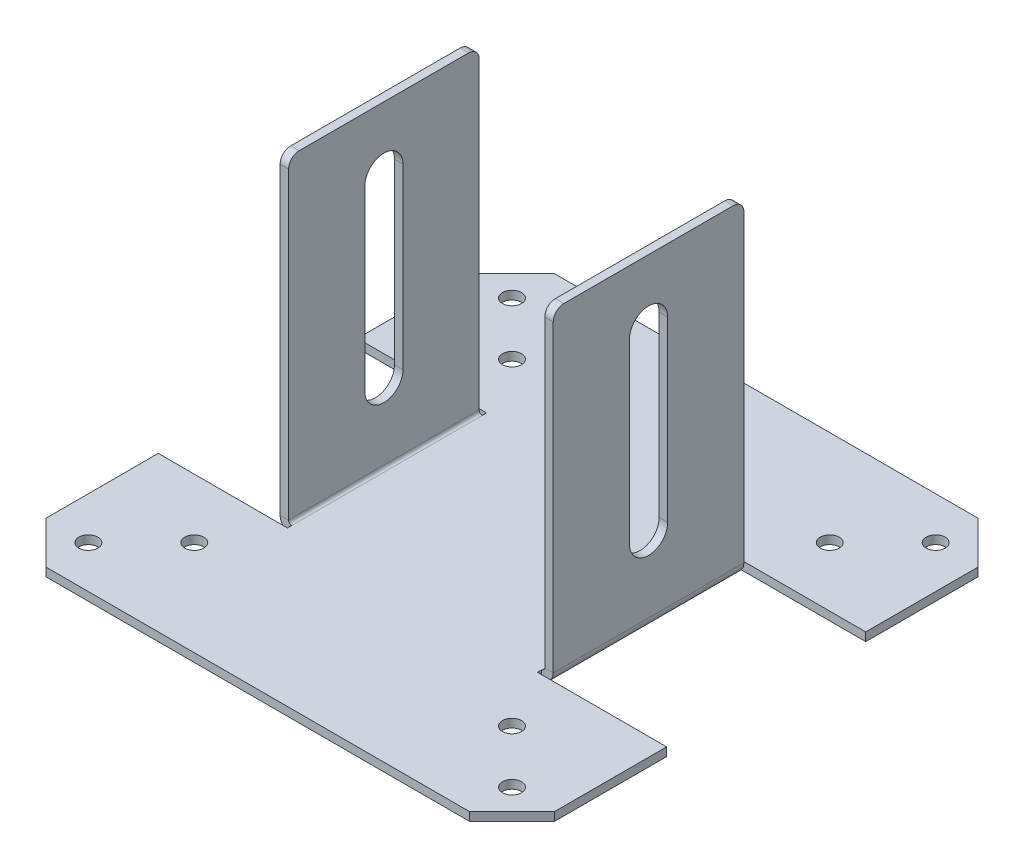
ISO-10303-21;
HEADER;
FILE_DESCRIPTION(('STEP AP214'),'2;1');
FILE_NAME('part.step','',(''),(''),'','','');
FILE_SCHEMA(('AUTOMOTIVE_DESIGN { 1 0 10303 214 1 1 1 1 }'));
ENDSEC;
DATA;
#1=APPLICATION_CONTEXT('core data for automotive mechanical design processes');
#2=APPLICATION_PROTOCOL_DEFINITION('international standard','automotive_design',2000,#1);
#3=PRODUCT_CONTEXT('',#1,'mechanical');
#4=PRODUCT('Part','Part','',(#3));
#5=PRODUCT_RELATED_PRODUCT_CATEGORY('part','',(#4));
#6=PRODUCT_DEFINITION_FORMATION('','',#4);
#7=PRODUCT_DEFINITION_CONTEXT('part definition',#1,'design');
#8=PRODUCT_DEFINITION('design','',#6,#7);
#9=PRODUCT_DEFINITION_SHAPE('','',#8);
#10=(LENGTH_UNIT() NAMED_UNIT(*) SI_UNIT(.MILLI.,.METRE.));
#11=(NAMED_UNIT(*) PLANE_ANGLE_UNIT() SI_UNIT($,.RADIAN.));
#12=(NAMED_UNIT(*) SI_UNIT($,.STERADIAN.) SOLID_ANGLE_UNIT());
#13=UNCERTAINTY_MEASURE_WITH_UNIT(LENGTH_MEASURE(1.E-05),#10,'distance_accuracy_value','');
#14=(GEOMETRIC_REPRESENTATION_CONTEXT(3) GLOBAL_UNCERTAINTY_ASSIGNED_CONTEXT((#13)) GLOBAL_UNIT_ASSIGNED_CONTEXT((#10,
#11,#12)) REPRESENTATION_CONTEXT('',''));
#15=CARTESIAN_POINT('',(0.,0.,0.));
#16=DIRECTION('',(0.,0.,1.));
#17=DIRECTION('',(1.,0.,0.));
#18=AXIS2_PLACEMENT_3D('',#15,#16,#17);
#19=CARTESIAN_POINT('',(29.5,-2.,-23.5));
#20=DIRECTION('',(1.,0.,0.));
#21=DIRECTION('',(0.,0.,-1.));
#22=AXIS2_PLACEMENT_3D('',#19,#20,#21);
#23=PLANE('',#22);
#24=DIRECTION('',(0.,0.,-1.));
#25=VECTOR('',#24,1.);
#26=CARTESIAN_POINT('',(29.5,0.,-23.5));
#27=LINE('',#26,#25);
#28=CARTESIAN_POINT('',(29.5,-2.05889992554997E-13,-22.5));
#29=VERTEX_POINT('',#28);
#30=CARTESIAN_POINT('',(29.5,0.,-23.5));
#31=VERTEX_POINT('',#30);
#32=EDGE_CURVE('E678',#29,#31,#27,.T.);
#33=ORIENTED_EDGE('',*,*,#32,.F.);
#34=DIRECTION('',(0.,-1.,0.));
#35=VECTOR('',#34,1.);
#36=CARTESIAN_POINT('',(29.5,-2.05889992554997E-13,-22.5));
#37=LINE('',#36,#35);
#38=CARTESIAN_POINT('',(29.5,-2.,-22.5));
#39=VERTEX_POINT('',#38);
#40=EDGE_CURVE('E472',#29,#39,#37,.T.);
#41=ORIENTED_EDGE('',*,*,#40,.T.);
#42=DIRECTION('',(0.,0.,-1.));
#43=VECTOR('',#42,1.);
#44=CARTESIAN_POINT('',(29.5,-2.,-23.5));
#45=LINE('',#44,#43);
#46=CARTESIAN_POINT('',(29.5,-2.,-23.5));
#47=VERTEX_POINT('',#46);
#48=EDGE_CURVE('E630',#39,#47,#45,.T.);
#49=ORIENTED_EDGE('',*,*,#48,.T.);
#50=DIRECTION('',(0.,1.,0.));
#51=VECTOR('',#50,1.);
#52=CARTESIAN_POINT('',(29.5,-2.,-23.5));
#53=LINE('',#52,#51);
#54=EDGE_CURVE('E736',#47,#31,#53,.T.);
#55=ORIENTED_EDGE('',*,*,#54,.T.);
#56=EDGE_LOOP('',(#33,#41,#49,#55));
#57=FACE_BOUND('',#56,.T.);
#58=ADVANCED_FACE('F95',(#57),#23,.T.);
#59=CARTESIAN_POINT('',(-29.5,-2.,-23.5));
#60=DIRECTION('',(-1.,0.,0.));
#61=DIRECTION('',(0.,0.,1.));
#62=AXIS2_PLACEMENT_3D('',#59,#60,#61);
#63=PLANE('',#62);
#64=DIRECTION('',(0.,0.,1.));
#65=VECTOR('',#64,1.);
#66=CARTESIAN_POINT('',(-29.5,0.,-23.5));
#67=LINE('',#66,#65);
#68=CARTESIAN_POINT('',(-29.5,0.,22.5));
#69=VERTEX_POINT('',#68);
#70=CARTESIAN_POINT('',(-29.5,0.,23.5));
#71=VERTEX_POINT('',#70);
#72=EDGE_CURVE('E702',#69,#71,#67,.T.);
#73=ORIENTED_EDGE('',*,*,#72,.F.);
#74=DIRECTION('',(0.,-1.,0.));
#75=VECTOR('',#74,1.);
#76=CARTESIAN_POINT('',(-29.5,0.,22.5));
#77=LINE('',#76,#75);
#78=CARTESIAN_POINT('',(-29.5,-2.,22.5));
#79=VERTEX_POINT('',#78);
#80=EDGE_CURVE('E538',#69,#79,#77,.T.);
#81=ORIENTED_EDGE('',*,*,#80,.T.);
#82=DIRECTION('',(0.,0.,1.));
#83=VECTOR('',#82,1.);
#84=CARTESIAN_POINT('',(-29.5,-2.,-23.5));
#85=LINE('',#84,#83);
#86=CARTESIAN_POINT('',(-29.5,-2.,23.5));
#87=VERTEX_POINT('',#86);
#88=EDGE_CURVE('E654',#79,#87,#85,.T.);
#89=ORIENTED_EDGE('',*,*,#88,.T.);
#90=DIRECTION('',(0.,1.,0.));
#91=VECTOR('',#90,1.);
#92=CARTESIAN_POINT('',(-29.5,-2.,23.5));
#93=LINE('',#92,#91);
#94=EDGE_CURVE('E722',#87,#71,#93,.T.);
#95=ORIENTED_EDGE('',*,*,#94,.T.);
#96=EDGE_LOOP('',(#73,#81,#89,#95));
#97=FACE_BOUND('',#96,.T.);
#98=ADVANCED_FACE('F1165',(#97),#63,.T.);
#99=CARTESIAN_POINT('',(60.,-2.,23.5));
#100=DIRECTION('',(1.,0.,0.));
#101=DIRECTION('',(0.,0.,-1.));
#102=AXIS2_PLACEMENT_3D('',#99,#100,#101);
#103=PLANE('',#102);
#104=DIRECTION('',(0.,0.,-1.));
#105=VECTOR('',#104,1.);
#106=CARTESIAN_POINT('',(60.,0.,23.5));
#107=LINE('',#106,#105);
#108=CARTESIAN_POINT('',(60.,0.,50.));
#109=VERTEX_POINT('',#108);
#110=CARTESIAN_POINT('',(60.,0.,23.5));
#111=VERTEX_POINT('',#110);
#112=EDGE_CURVE('E621',#109,#111,#107,.T.);
#113=ORIENTED_EDGE('',*,*,#112,.F.);
#114=DIRECTION('',(0.,-1.,0.));
#115=VECTOR('',#114,1.);
#116=CARTESIAN_POINT('',(60.,-2.,50.));
#117=LINE('',#116,#115);
#118=CARTESIAN_POINT('',(60.,-2.,50.));
#119=VERTEX_POINT('',#118);
#120=EDGE_CURVE('E794',#109,#119,#117,.T.);
#121=ORIENTED_EDGE('',*,*,#120,.T.);
#122=DIRECTION('',(0.,0.,-1.));
#123=VECTOR('',#122,1.);
#124=CARTESIAN_POINT('',(60.,-2.,23.5));
#125=LINE('',#124,#123);
#126=CARTESIAN_POINT('',(60.,-2.,23.5));
#127=VERTEX_POINT('',#126);
#128=EDGE_CURVE('E622',#119,#127,#125,.T.);
#129=ORIENTED_EDGE('',*,*,#128,.T.);
#130=DIRECTION('',(0.,1.,0.));
#131=VECTOR('',#130,1.);
#132=CARTESIAN_POINT('',(60.,-2.,23.5));
#133=LINE('',#132,#131);
#134=EDGE_CURVE('E671',#127,#111,#133,.T.);
#135=ORIENTED_EDGE('',*,*,#134,.T.);
#136=EDGE_LOOP('',(#113,#121,#129,#135));
#137=FACE_BOUND('',#136,.T.);
#138=ADVANCED_FACE('F1194',(#137),#103,.T.);
#139=CARTESIAN_POINT('',(-60.,-2.,60.));
#140=DIRECTION('',(0.,0.,1.));
#141=DIRECTION('',(1.,0.,0.));
#142=AXIS2_PLACEMENT_3D('',#139,#140,#141);
#143=PLANE('',#142);
#144=DIRECTION('',(1.,0.,0.));
#145=VECTOR('',#144,1.);
#146=CARTESIAN_POINT('',(-60.,0.,60.));
#147=LINE('',#146,#145);
#148=CARTESIAN_POINT('',(-50.,0.,60.));
#149=VERTEX_POINT('',#148);
#150=CARTESIAN_POINT('',(50.,0.,60.));
#151=VERTEX_POINT('',#150);
#152=EDGE_CURVE('E626',#149,#151,#147,.T.);
#153=ORIENTED_EDGE('',*,*,#152,.F.);
#154=DIRECTION('',(0.,-1.,0.));
#155=VECTOR('',#154,1.);
#156=CARTESIAN_POINT('',(-50.,-2.,60.));
#157=LINE('',#156,#155);
#158=CARTESIAN_POINT('',(-50.,-2.,60.));
#159=VERTEX_POINT('',#158);
#160=EDGE_CURVE('E765',#149,#159,#157,.T.);
#161=ORIENTED_EDGE('',*,*,#160,.T.);
#162=DIRECTION('',(1.,0.,0.));
#163=VECTOR('',#162,1.);
#164=CARTESIAN_POINT('',(-60.,-2.,60.));
#165=LINE('',#164,#163);
#166=CARTESIAN_POINT('',(50.,-2.,60.));
#167=VERTEX_POINT('',#166);
#168=EDGE_CURVE('E667',#159,#167,#165,.T.);
#169=ORIENTED_EDGE('',*,*,#168,.T.);
#170=DIRECTION('',(0.,1.,0.));
#171=VECTOR('',#170,1.);
#172=CARTESIAN_POINT('',(50.,-2.,60.));
#173=LINE('',#172,#171);
#174=EDGE_CURVE('E761',#167,#151,#173,.T.);
#175=ORIENTED_EDGE('',*,*,#174,.T.);
#176=EDGE_LOOP('',(#153,#161,#169,#175));
#177=FACE_BOUND('',#176,.T.);
#178=ADVANCED_FACE('F1186',(#177),#143,.T.);
#179=CARTESIAN_POINT('',(-60.,-2.,23.5));
#180=DIRECTION('',(-1.,0.,0.));
#181=DIRECTION('',(0.,0.,1.));
#182=AXIS2_PLACEMENT_3D('',#179,#180,#181);
#183=PLANE('',#182);
#184=DIRECTION('',(0.,0.,1.));
#185=VECTOR('',#184,1.);
#186=CARTESIAN_POINT('',(-60.,-2.,23.5));
#187=LINE('',#186,#185);
#188=CARTESIAN_POINT('',(-60.,-2.,23.5));
#189=VERTEX_POINT('',#188);
#190=CARTESIAN_POINT('',(-60.,-2.,50.));
#191=VERTEX_POINT('',#190);
#192=EDGE_CURVE('E663',#189,#191,#187,.T.);
#193=ORIENTED_EDGE('',*,*,#192,.T.);
#194=DIRECTION('',(0.,1.,0.));
#195=VECTOR('',#194,1.);
#196=CARTESIAN_POINT('',(-60.,-2.,50.));
#197=LINE('',#196,#195);
#198=CARTESIAN_POINT('',(-60.,0.,50.));
#199=VERTEX_POINT('',#198);
#200=EDGE_CURVE('E721',#191,#199,#197,.T.);
#201=ORIENTED_EDGE('',*,*,#200,.T.);
#202=DIRECTION('',(0.,0.,1.));
#203=VECTOR('',#202,1.);
#204=CARTESIAN_POINT('',(-60.,0.,23.5));
#205=LINE('',#204,#203);
#206=CARTESIAN_POINT('',(-60.,0.,23.5));
#207=VERTEX_POINT('',#206);
#208=EDGE_CURVE('E711',#207,#199,#205,.T.);
#209=ORIENTED_EDGE('',*,*,#208,.F.);
#210=DIRECTION('',(0.,1.,0.));
#211=VECTOR('',#210,1.);
#212=CARTESIAN_POINT('',(-60.,-2.,23.5));
#213=LINE('',#212,#211);
#214=EDGE_CURVE('E718',#189,#207,#213,.T.);
#215=ORIENTED_EDGE('',*,*,#214,.F.);
#216=EDGE_LOOP('',(#193,#201,#209,#215));
#217=FACE_BOUND('',#216,.T.);
#218=ADVANCED_FACE('F1177',(#217),#183,.T.);
#219=CARTESIAN_POINT('',(-29.5,-2.,23.5));
#220=DIRECTION('',(0.,0.,-1.));
#221=DIRECTION('',(-1.,0.,0.));
#222=AXIS2_PLACEMENT_3D('',#219,#220,#221);
#223=PLANE('',#222);
#224=DIRECTION('',(-1.,0.,0.));
#225=VECTOR('',#224,1.);
#226=CARTESIAN_POINT('',(-29.5,0.,23.5));
#227=LINE('',#226,#225);
#228=EDGE_CURVE('E707',#71,#207,#227,.T.);
#229=ORIENTED_EDGE('',*,*,#228,.F.);
#230=ORIENTED_EDGE('',*,*,#94,.F.);
#231=DIRECTION('',(-1.,0.,0.));
#232=VECTOR('',#231,1.);
#233=CARTESIAN_POINT('',(-29.5,-2.,23.5));
#234=LINE('',#233,#232);
#235=EDGE_CURVE('E659',#87,#189,#234,.T.);
#236=ORIENTED_EDGE('',*,*,#235,.T.);
#237=ORIENTED_EDGE('',*,*,#214,.T.);
#238=EDGE_LOOP('',(#229,#230,#236,#237));
#239=FACE_BOUND('',#238,.T.);
#240=ADVANCED_FACE('F1170',(#239),#223,.T.);
#241=DIRECTION('',(0.,-1.,0.));
#242=VECTOR('',#241,1.);
#243=CARTESIAN_POINT('',(-29.5,0.,-22.5));
#244=LINE('',#243,#242);
#245=CARTESIAN_POINT('',(-29.5,0.,-22.5));
#246=VERTEX_POINT('',#245);
#247=CARTESIAN_POINT('',(-29.5,-2.,-22.5));
#248=VERTEX_POINT('',#247);
#249=EDGE_CURVE('E551',#246,#248,#244,.T.);
#250=ORIENTED_EDGE('',*,*,#249,.F.);
#251=CARTESIAN_POINT('',(-29.5,0.,-23.5));
#252=VERTEX_POINT('',#251);
#253=EDGE_CURVE('E703',#252,#246,#67,.T.);
#254=ORIENTED_EDGE('',*,*,#253,.F.);
#255=DIRECTION('',(0.,1.,0.));
#256=VECTOR('',#255,1.);
#257=CARTESIAN_POINT('',(-29.5,-2.,-23.5));
#258=LINE('',#257,#256);
#259=CARTESIAN_POINT('',(-29.5,-2.,-23.5));
#260=VERTEX_POINT('',#259);
#261=EDGE_CURVE('E726',#260,#252,#258,.T.);
#262=ORIENTED_EDGE('',*,*,#261,.F.);
#263=EDGE_CURVE('E655',#260,#248,#85,.T.);
#264=ORIENTED_EDGE('',*,*,#263,.T.);
#265=EDGE_LOOP('',(#250,#254,#262,#264));
#266=FACE_BOUND('',#265,.T.);
#267=ADVANCED_FACE('F1255',(#266),#63,.T.);
#268=CARTESIAN_POINT('',(-60.,-2.,-23.5));
#269=DIRECTION('',(0.,0.,1.));
#270=DIRECTION('',(1.,0.,0.));
#271=AXIS2_PLACEMENT_3D('',#268,#269,#270);
#272=PLANE('',#271);
#273=DIRECTION('',(1.,0.,0.));
#274=VECTOR('',#273,1.);
#275=CARTESIAN_POINT('',(-60.,0.,-23.5));
#276=LINE('',#275,#274);
#277=CARTESIAN_POINT('',(-60.,0.,-23.5));
#278=VERTEX_POINT('',#277);
#279=EDGE_CURVE('E698',#278,#252,#276,.T.);
#280=ORIENTED_EDGE('',*,*,#279,.F.);
#281=DIRECTION('',(0.,1.,0.));
#282=VECTOR('',#281,1.);
#283=CARTESIAN_POINT('',(-60.,-2.,-23.5));
#284=LINE('',#283,#282);
#285=CARTESIAN_POINT('',(-60.,-2.,-23.5));
#286=VERTEX_POINT('',#285);
#287=EDGE_CURVE('E729',#286,#278,#284,.T.);
#288=ORIENTED_EDGE('',*,*,#287,.F.);
#289=DIRECTION('',(1.,0.,0.));
#290=VECTOR('',#289,1.);
#291=CARTESIAN_POINT('',(-60.,-2.,-23.5));
#292=LINE('',#291,#290);
#293=EDGE_CURVE('E650',#286,#260,#292,.T.);
#294=ORIENTED_EDGE('',*,*,#293,.T.);
#295=ORIENTED_EDGE('',*,*,#261,.T.);
#296=EDGE_LOOP('',(#280,#288,#294,#295));
#297=FACE_BOUND('',#296,.T.);
#298=ADVANCED_FACE('F1250',(#297),#272,.T.);
#299=CARTESIAN_POINT('',(-60.,-2.,-60.));
#300=DIRECTION('',(-1.,0.,0.));
#301=DIRECTION('',(0.,0.,1.));
#302=AXIS2_PLACEMENT_3D('',#299,#300,#301);
#303=PLANE('',#302);
#304=DIRECTION('',(0.,0.,1.));
#305=VECTOR('',#304,1.);
#306=CARTESIAN_POINT('',(-60.,0.,-60.));
#307=LINE('',#306,#305);
#308=CARTESIAN_POINT('',(-60.,0.,-50.));
#309=VERTEX_POINT('',#308);
#310=EDGE_CURVE('E695',#309,#278,#307,.T.);
#311=ORIENTED_EDGE('',*,*,#310,.F.);
#312=DIRECTION('',(0.,-1.,0.));
#313=VECTOR('',#312,1.);
#314=CARTESIAN_POINT('',(-60.,-2.,-50.));
#315=LINE('',#314,#313);
#316=CARTESIAN_POINT('',(-60.,-2.,-50.));
#317=VERTEX_POINT('',#316);
#318=EDGE_CURVE('E787',#309,#317,#315,.T.);
#319=ORIENTED_EDGE('',*,*,#318,.T.);
#320=DIRECTION('',(0.,0.,1.));
#321=VECTOR('',#320,1.);
#322=CARTESIAN_POINT('',(-60.,-2.,-60.));
#323=LINE('',#322,#321);
#324=EDGE_CURVE('E647',#317,#286,#323,.T.);
#325=ORIENTED_EDGE('',*,*,#324,.T.);
#326=ORIENTED_EDGE('',*,*,#287,.T.);
#327=EDGE_LOOP('',(#311,#319,#325,#326));
#328=FACE_BOUND('',#327,.T.);
#329=ADVANCED_FACE('F1246',(#328),#303,.T.);
#330=CARTESIAN_POINT('',(-60.,-2.,-60.));
#331=DIRECTION('',(0.,0.,-1.));
#332=DIRECTION('',(-1.,0.,0.));
#333=AXIS2_PLACEMENT_3D('',#330,#331,#332);
#334=PLANE('',#333);
#335=DIRECTION('',(-1.,0.,0.));
#336=VECTOR('',#335,1.);
#337=CARTESIAN_POINT('',(-60.,-2.,-60.));
#338=LINE('',#337,#336);
#339=CARTESIAN_POINT('',(50.,-2.,-60.));
#340=VERTEX_POINT('',#339);
#341=CARTESIAN_POINT('',(-50.,-2.,-60.));
#342=VERTEX_POINT('',#341);
#343=EDGE_CURVE('E643',#340,#342,#338,.T.);
#344=ORIENTED_EDGE('',*,*,#343,.T.);
#345=DIRECTION('',(0.,1.,0.));
#346=VECTOR('',#345,1.);
#347=CARTESIAN_POINT('',(-50.,-2.,-60.));
#348=LINE('',#347,#346);
#349=CARTESIAN_POINT('',(-50.,0.,-60.));
#350=VERTEX_POINT('',#349);
#351=EDGE_CURVE('E783',#342,#350,#348,.T.);
#352=ORIENTED_EDGE('',*,*,#351,.T.);
#353=DIRECTION('',(-1.,0.,0.));
#354=VECTOR('',#353,1.);
#355=CARTESIAN_POINT('',(-60.,0.,-60.));
#356=LINE('',#355,#354);
#357=CARTESIAN_POINT('',(50.,0.,-60.));
#358=VERTEX_POINT('',#357);
#359=EDGE_CURVE('E691',#358,#350,#356,.T.);
#360=ORIENTED_EDGE('',*,*,#359,.F.);
#361=DIRECTION('',(0.,-1.,0.));
#362=VECTOR('',#361,1.);
#363=CARTESIAN_POINT('',(50.,-2.,-60.));
#364=LINE('',#363,#362);
#365=EDGE_CURVE('E780',#358,#340,#364,.T.);
#366=ORIENTED_EDGE('',*,*,#365,.T.);
#367=EDGE_LOOP('',(#344,#352,#360,#366));
#368=FACE_BOUND('',#367,.T.);
#369=ADVANCED_FACE('F1236',(#368),#334,.T.);
#370=CARTESIAN_POINT('',(60.,-2.,-60.));
#371=DIRECTION('',(1.,0.,0.));
#372=DIRECTION('',(0.,0.,-1.));
#373=AXIS2_PLACEMENT_3D('',#370,#371,#372);
#374=PLANE('',#373);
#375=DIRECTION('',(0.,0.,-1.));
#376=VECTOR('',#375,1.);
#377=CARTESIAN_POINT('',(60.,-2.,-60.));
#378=LINE('',#377,#376);
#379=CARTESIAN_POINT('',(60.,-2.,-23.5));
#380=VERTEX_POINT('',#379);
#381=CARTESIAN_POINT('',(60.,-2.,-50.));
#382=VERTEX_POINT('',#381);
#383=EDGE_CURVE('E639',#380,#382,#378,.T.);
#384=ORIENTED_EDGE('',*,*,#383,.T.);
#385=DIRECTION('',(0.,1.,0.));
#386=VECTOR('',#385,1.);
#387=CARTESIAN_POINT('',(60.,-2.,-50.));
#388=LINE('',#387,#386);
#389=CARTESIAN_POINT('',(60.,0.,-50.));
#390=VERTEX_POINT('',#389);
#391=EDGE_CURVE('E790',#382,#390,#388,.T.);
#392=ORIENTED_EDGE('',*,*,#391,.T.);
#393=DIRECTION('',(0.,0.,-1.));
#394=VECTOR('',#393,1.);
#395=CARTESIAN_POINT('',(60.,0.,-60.));
#396=LINE('',#395,#394);
#397=CARTESIAN_POINT('',(60.,0.,-23.5));
#398=VERTEX_POINT('',#397);
#399=EDGE_CURVE('E687',#398,#390,#396,.T.);
#400=ORIENTED_EDGE('',*,*,#399,.F.);
#401=DIRECTION('',(0.,1.,0.));
#402=VECTOR('',#401,1.);
#403=CARTESIAN_POINT('',(60.,-2.,-23.5));
#404=LINE('',#403,#402);
#405=EDGE_CURVE('E733',#380,#398,#404,.T.);
#406=ORIENTED_EDGE('',*,*,#405,.F.);
#407=EDGE_LOOP('',(#384,#392,#400,#406));
#408=FACE_BOUND('',#407,.T.);
#409=ADVANCED_FACE('F1228',(#408),#374,.T.);
#410=CARTESIAN_POINT('',(60.,-2.,-23.5));
#411=DIRECTION('',(0.,0.,1.));
#412=DIRECTION('',(1.,0.,0.));
#413=AXIS2_PLACEMENT_3D('',#410,#411,#412);
#414=PLANE('',#413);
#415=DIRECTION('',(1.,0.,0.));
#416=VECTOR('',#415,1.);
#417=CARTESIAN_POINT('',(60.,0.,-23.5));
#418=LINE('',#417,#416);
#419=EDGE_CURVE('E683',#31,#398,#418,.T.);
#420=ORIENTED_EDGE('',*,*,#419,.F.);
#421=ORIENTED_EDGE('',*,*,#54,.F.);
#422=DIRECTION('',(1.,0.,0.));
#423=VECTOR('',#422,1.);
#424=CARTESIAN_POINT('',(60.,-2.,-23.5));
#425=LINE('',#424,#423);
#426=EDGE_CURVE('E635',#47,#380,#425,.T.);
#427=ORIENTED_EDGE('',*,*,#426,.T.);
#428=ORIENTED_EDGE('',*,*,#405,.T.);
#429=EDGE_LOOP('',(#420,#421,#427,#428));
#430=FACE_BOUND('',#429,.T.);
#431=ADVANCED_FACE('F1224',(#430),#414,.T.);
#432=DIRECTION('',(0.,-1.,0.));
#433=VECTOR('',#432,1.);
#434=CARTESIAN_POINT('',(29.5,-2.15864652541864E-13,22.5));
#435=LINE('',#434,#433);
#436=CARTESIAN_POINT('',(29.5,-2.15864652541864E-13,22.5));
#437=VERTEX_POINT('',#436);
#438=CARTESIAN_POINT('',(29.5,-2.00000000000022,22.5));
#439=VERTEX_POINT('',#438);
#440=EDGE_CURVE('E485',#437,#439,#435,.T.);
#441=ORIENTED_EDGE('',*,*,#440,.F.);
#442=CARTESIAN_POINT('',(29.5,0.,23.5));
#443=VERTEX_POINT('',#442);
#444=EDGE_CURVE('E679',#443,#437,#27,.T.);
#445=ORIENTED_EDGE('',*,*,#444,.F.);
#446=DIRECTION('',(0.,1.,0.));
#447=VECTOR('',#446,1.);
#448=CARTESIAN_POINT('',(29.5,-2.,23.5));
#449=LINE('',#448,#447);
#450=CARTESIAN_POINT('',(29.5,-2.,23.5));
#451=VERTEX_POINT('',#450);
#452=EDGE_CURVE('E740',#451,#443,#449,.T.);
#453=ORIENTED_EDGE('',*,*,#452,.F.);
#454=EDGE_CURVE('E631',#451,#439,#45,.T.);
#455=ORIENTED_EDGE('',*,*,#454,.T.);
#456=EDGE_LOOP('',(#441,#445,#453,#455));
#457=FACE_BOUND('',#456,.T.);
#458=ADVANCED_FACE('F1205',(#457),#23,.T.);
#459=CARTESIAN_POINT('',(29.5,-2.,23.5));
#460=DIRECTION('',(0.,0.,-1.));
#461=DIRECTION('',(-1.,0.,0.));
#462=AXIS2_PLACEMENT_3D('',#459,#460,#461);
#463=PLANE('',#462);
#464=DIRECTION('',(-1.,0.,0.));
#465=VECTOR('',#464,1.);
#466=CARTESIAN_POINT('',(29.5,0.,23.5));
#467=LINE('',#466,#465);
#468=EDGE_CURVE('E674',#111,#443,#467,.T.);
#469=ORIENTED_EDGE('',*,*,#468,.F.);
#470=ORIENTED_EDGE('',*,*,#134,.F.);
#471=DIRECTION('',(-1.,0.,0.));
#472=VECTOR('',#471,1.);
#473=CARTESIAN_POINT('',(29.5,-2.,23.5));
#474=LINE('',#473,#472);
#475=EDGE_CURVE('E625',#127,#451,#474,.T.);
#476=ORIENTED_EDGE('',*,*,#475,.T.);
#477=ORIENTED_EDGE('',*,*,#452,.T.);
#478=EDGE_LOOP('',(#469,#470,#476,#477));
#479=FACE_BOUND('',#478,.T.);
#480=ADVANCED_FACE('F1200',(#479),#463,.T.);
#481=CARTESIAN_POINT('',(0.,-2.,0.));
#482=DIRECTION('',(0.,1.,0.));
#483=DIRECTION('',(0.,0.,1.));
#484=AXIS2_PLACEMENT_3D('',#481,#482,#483);
#485=PLANE('',#484);
#486=CARTESIAN_POINT('',(-50.,-2.,-50.));
#487=DIRECTION('',(0.,1.,0.));
#488=DIRECTION('',(0.,0.,1.));
#489=AXIS2_PLACEMENT_3D('',#486,#487,#488);
#490=CIRCLE('',#489,2.25);
#491=CARTESIAN_POINT('',(-50.,-2.,-47.75));
#492=VERTEX_POINT('',#491);
#493=EDGE_CURVE('E561',#492,#492,#490,.T.);
#494=ORIENTED_EDGE('',*,*,#493,.T.);
#495=EDGE_LOOP('',(#494));
#496=FACE_BOUND('',#495,.T.);
#497=CARTESIAN_POINT('',(50.,-2.,-50.));
#498=DIRECTION('',(0.,1.,0.));
#499=DIRECTION('',(0.,0.,1.));
#500=AXIS2_PLACEMENT_3D('',#497,#498,#499);
#501=CIRCLE('',#500,2.25);
#502=CARTESIAN_POINT('',(50.,-2.,-47.75));
#503=VERTEX_POINT('',#502);
#504=EDGE_CURVE('E569',#503,#503,#501,.T.);
#505=ORIENTED_EDGE('',*,*,#504,.T.);
#506=EDGE_LOOP('',(#505));
#507=FACE_BOUND('',#506,.T.);
#508=CARTESIAN_POINT('',(50.,-2.,50.));
#509=DIRECTION('',(0.,1.,0.));
#510=DIRECTION('',(0.,0.,1.));
#511=AXIS2_PLACEMENT_3D('',#508,#509,#510);
#512=CIRCLE('',#511,2.25);
#513=CARTESIAN_POINT('',(50.,-2.,52.25));
#514=VERTEX_POINT('',#513);
#515=EDGE_CURVE('E577',#514,#514,#512,.T.);
#516=ORIENTED_EDGE('',*,*,#515,.T.);
#517=EDGE_LOOP('',(#516));
#518=FACE_BOUND('',#517,.T.);
#519=CARTESIAN_POINT('',(-50.,-2.,50.));
#520=DIRECTION('',(0.,1.,0.));
#521=DIRECTION('',(0.,0.,1.));
#522=AXIS2_PLACEMENT_3D('',#519,#520,#521);
#523=CIRCLE('',#522,2.25);
#524=CARTESIAN_POINT('',(-50.,-2.,52.25));
#525=VERTEX_POINT('',#524);
#526=EDGE_CURVE('E585',#525,#525,#523,.T.);
#527=ORIENTED_EDGE('',*,*,#526,.T.);
#528=EDGE_LOOP('',(#527));
#529=FACE_BOUND('',#528,.T.);
#530=CARTESIAN_POINT('',(-37.5,-2.,-37.5));
#531=DIRECTION('',(0.,1.,0.));
#532=DIRECTION('',(0.,0.,1.));
#533=AXIS2_PLACEMENT_3D('',#530,#531,#532);
#534=CIRCLE('',#533,2.25);
#535=CARTESIAN_POINT('',(-37.5,-2.,-35.25));
#536=VERTEX_POINT('',#535);
#537=EDGE_CURVE('E593',#536,#536,#534,.T.);
#538=ORIENTED_EDGE('',*,*,#537,.T.);
#539=EDGE_LOOP('',(#538));
#540=FACE_BOUND('',#539,.T.);
#541=CARTESIAN_POINT('',(37.5,-2.,-37.5));
#542=DIRECTION('',(0.,1.,0.));
#543=DIRECTION('',(0.,0.,1.));
#544=AXIS2_PLACEMENT_3D('',#541,#542,#543);
#545=CIRCLE('',#544,2.25);
#546=CARTESIAN_POINT('',(37.5,-2.,-35.25));
#547=VERTEX_POINT('',#546);
#548=EDGE_CURVE('E601',#547,#547,#545,.T.);
#549=ORIENTED_EDGE('',*,*,#548,.T.);
#550=EDGE_LOOP('',(#549));
#551=FACE_BOUND('',#550,.T.);
#552=CARTESIAN_POINT('',(37.5,-2.,37.5));
#553=DIRECTION('',(0.,1.,0.));
#554=DIRECTION('',(0.,0.,1.));
#555=AXIS2_PLACEMENT_3D('',#552,#553,#554);
#556=CIRCLE('',#555,2.25);
#557=CARTESIAN_POINT('',(37.5,-2.,39.75));
#558=VERTEX_POINT('',#557);
#559=EDGE_CURVE('E609',#558,#558,#556,.T.);
#560=ORIENTED_EDGE('',*,*,#559,.T.);
#561=EDGE_LOOP('',(#560));
#562=FACE_BOUND('',#561,.T.);
#563=CARTESIAN_POINT('',(-37.5,-2.,37.5));
#564=DIRECTION('',(0.,1.,0.));
#565=DIRECTION('',(0.,0.,1.));
#566=AXIS2_PLACEMENT_3D('',#563,#564,#565);
#567=CIRCLE('',#566,2.25);
#568=CARTESIAN_POINT('',(-37.5,-2.,39.75));
#569=VERTEX_POINT('',#568);
#570=EDGE_CURVE('E617',#569,#569,#567,.T.);
#571=ORIENTED_EDGE('',*,*,#570,.T.);
#572=EDGE_LOOP('',(#571));
#573=FACE_BOUND('',#572,.T.);
#574=ORIENTED_EDGE('',*,*,#168,.F.);
#575=DIRECTION('',(0.707106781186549,0.,0.707106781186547));
#576=VECTOR('',#575,1.);
#577=CARTESIAN_POINT('',(-60.,-2.,50.));
#578=LINE('',#577,#576);
#579=EDGE_CURVE('E777',#159,#191,#578,.F.);
#580=ORIENTED_EDGE('',*,*,#579,.T.);
#581=ORIENTED_EDGE('',*,*,#192,.F.);
#582=ORIENTED_EDGE('',*,*,#235,.F.);
#583=ORIENTED_EDGE('',*,*,#88,.F.);
#584=DIRECTION('',(0.,0.,1.));
#585=VECTOR('',#584,1.);
#586=CARTESIAN_POINT('',(-29.5,-2.00000000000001,22.5));
#587=LINE('',#586,#585);
#588=EDGE_CURVE('E529',#79,#248,#587,.F.);
#589=ORIENTED_EDGE('',*,*,#588,.T.);
#590=ORIENTED_EDGE('',*,*,#263,.F.);
#591=ORIENTED_EDGE('',*,*,#293,.F.);
#592=ORIENTED_EDGE('',*,*,#324,.F.);
#593=DIRECTION('',(-0.707106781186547,0.,0.707106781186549));
#594=VECTOR('',#593,1.);
#595=CARTESIAN_POINT('',(-50.,-2.,-60.));
#596=LINE('',#595,#594);
#597=EDGE_CURVE('E774',#317,#342,#596,.F.);
#598=ORIENTED_EDGE('',*,*,#597,.T.);
#599=ORIENTED_EDGE('',*,*,#343,.F.);
#600=DIRECTION('',(-0.707106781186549,0.,-0.707106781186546));
#601=VECTOR('',#600,1.);
#602=CARTESIAN_POINT('',(60.,-2.,-50.));
#603=LINE('',#602,#601);
#604=EDGE_CURVE('E771',#340,#382,#603,.F.);
#605=ORIENTED_EDGE('',*,*,#604,.T.);
#606=ORIENTED_EDGE('',*,*,#383,.F.);
#607=ORIENTED_EDGE('',*,*,#426,.F.);
#608=ORIENTED_EDGE('',*,*,#48,.F.);
#609=DIRECTION('',(0.,0.,-1.));
#610=VECTOR('',#609,1.);
#611=CARTESIAN_POINT('',(29.5,-2.00000000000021,-22.5));
#612=LINE('',#611,#610);
#613=EDGE_CURVE('E463',#39,#439,#612,.F.);
#614=ORIENTED_EDGE('',*,*,#613,.T.);
#615=ORIENTED_EDGE('',*,*,#454,.F.);
#616=ORIENTED_EDGE('',*,*,#475,.F.);
#617=ORIENTED_EDGE('',*,*,#128,.F.);
#618=DIRECTION('',(0.707106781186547,0.,-0.707106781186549));
#619=VECTOR('',#618,1.);
#620=CARTESIAN_POINT('',(50.,-2.,60.));
#621=LINE('',#620,#619);
#622=EDGE_CURVE('E768',#119,#167,#621,.F.);
#623=ORIENTED_EDGE('',*,*,#622,.T.);
#624=EDGE_LOOP('',(#574,#580,#581,#582,#583,#589,#590,#591,#592,#598,#599,#605,#606,#607,#608,
#614,#615,#616,#617,#623));
#625=FACE_BOUND('',#624,.T.);
#626=ADVANCED_FACE('F1173',(#496,#507,#518,#529,#540,#551,#562,#573,#625),#485,.F.);
#627=CARTESIAN_POINT('',(0.,0.,0.));
#628=DIRECTION('',(0.,1.,0.));
#629=DIRECTION('',(0.,0.,1.));
#630=AXIS2_PLACEMENT_3D('',#627,#628,#629);
#631=PLANE('',#630);
#632=CARTESIAN_POINT('',(-50.,0.,-50.));
#633=DIRECTION('',(0.,1.,0.));
#634=DIRECTION('',(0.,0.,1.));
#635=AXIS2_PLACEMENT_3D('',#632,#633,#634);
#636=CIRCLE('',#635,2.25);
#637=CARTESIAN_POINT('',(-50.,0.,-47.75));
#638=VERTEX_POINT('',#637);
#639=EDGE_CURVE('E554',#638,#638,#636,.T.);
#640=ORIENTED_EDGE('',*,*,#639,.F.);
#641=EDGE_LOOP('',(#640));
#642=FACE_BOUND('',#641,.T.);
#643=CARTESIAN_POINT('',(50.,0.,-50.));
#644=DIRECTION('',(0.,1.,0.));
#645=DIRECTION('',(0.,0.,1.));
#646=AXIS2_PLACEMENT_3D('',#643,#644,#645);
#647=CIRCLE('',#646,2.25);
#648=CARTESIAN_POINT('',(50.,0.,-47.75));
#649=VERTEX_POINT('',#648);
#650=EDGE_CURVE('E565',#649,#649,#647,.T.);
#651=ORIENTED_EDGE('',*,*,#650,.F.);
#652=EDGE_LOOP('',(#651));
#653=FACE_BOUND('',#652,.T.);
#654=CARTESIAN_POINT('',(50.,0.,50.));
#655=DIRECTION('',(0.,1.,0.));
#656=DIRECTION('',(0.,0.,1.));
#657=AXIS2_PLACEMENT_3D('',#654,#655,#656);
#658=CIRCLE('',#657,2.25);
#659=CARTESIAN_POINT('',(50.,0.,52.25));
#660=VERTEX_POINT('',#659);
#661=EDGE_CURVE('E573',#660,#660,#658,.T.);
#662=ORIENTED_EDGE('',*,*,#661,.F.);
#663=EDGE_LOOP('',(#662));
#664=FACE_BOUND('',#663,.T.);
#665=CARTESIAN_POINT('',(-50.,0.,50.));
#666=DIRECTION('',(0.,1.,0.));
#667=DIRECTION('',(0.,0.,1.));
#668=AXIS2_PLACEMENT_3D('',#665,#666,#667);
#669=CIRCLE('',#668,2.25);
#670=CARTESIAN_POINT('',(-50.,0.,52.25));
#671=VERTEX_POINT('',#670);
#672=EDGE_CURVE('E581',#671,#671,#669,.T.);
#673=ORIENTED_EDGE('',*,*,#672,.F.);
#674=EDGE_LOOP('',(#673));
#675=FACE_BOUND('',#674,.T.);
#676=CARTESIAN_POINT('',(-37.5,0.,-37.5));
#677=DIRECTION('',(0.,1.,0.));
#678=DIRECTION('',(0.,0.,1.));
#679=AXIS2_PLACEMENT_3D('',#676,#677,#678);
#680=CIRCLE('',#679,2.25);
#681=CARTESIAN_POINT('',(-37.5,0.,-35.25));
#682=VERTEX_POINT('',#681);
#683=EDGE_CURVE('E589',#682,#682,#680,.T.);
#684=ORIENTED_EDGE('',*,*,#683,.F.);
#685=EDGE_LOOP('',(#684));
#686=FACE_BOUND('',#685,.T.);
#687=CARTESIAN_POINT('',(37.5,0.,-37.5));
#688=DIRECTION('',(0.,1.,0.));
#689=DIRECTION('',(0.,0.,1.));
#690=AXIS2_PLACEMENT_3D('',#687,#688,#689);
#691=CIRCLE('',#690,2.25);
#692=CARTESIAN_POINT('',(37.5,0.,-35.25));
#693=VERTEX_POINT('',#692);
#694=EDGE_CURVE('E597',#693,#693,#691,.T.);
#695=ORIENTED_EDGE('',*,*,#694,.F.);
#696=EDGE_LOOP('',(#695));
#697=FACE_BOUND('',#696,.T.);
#698=CARTESIAN_POINT('',(37.5,0.,37.5));
#699=DIRECTION('',(0.,1.,0.));
#700=DIRECTION('',(0.,0.,1.));
#701=AXIS2_PLACEMENT_3D('',#698,#699,#700);
#702=CIRCLE('',#701,2.25);
#703=CARTESIAN_POINT('',(37.5,0.,39.75));
#704=VERTEX_POINT('',#703);
#705=EDGE_CURVE('E605',#704,#704,#702,.T.);
#706=ORIENTED_EDGE('',*,*,#705,.F.);
#707=EDGE_LOOP('',(#706));
#708=FACE_BOUND('',#707,.T.);
#709=CARTESIAN_POINT('',(-37.5,0.,37.5));
#710=DIRECTION('',(0.,1.,0.));
#711=DIRECTION('',(0.,0.,1.));
#712=AXIS2_PLACEMENT_3D('',#709,#710,#711);
#713=CIRCLE('',#712,2.25);
#714=CARTESIAN_POINT('',(-37.5,0.,39.75));
#715=VERTEX_POINT('',#714);
#716=EDGE_CURVE('E613',#715,#715,#713,.T.);
#717=ORIENTED_EDGE('',*,*,#716,.F.);
#718=EDGE_LOOP('',(#717));
#719=FACE_BOUND('',#718,.T.);
#720=ORIENTED_EDGE('',*,*,#208,.T.);
#721=DIRECTION('',(-0.707106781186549,0.,-0.707106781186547));
#722=VECTOR('',#721,1.);
#723=CARTESIAN_POINT('',(-54.9999999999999,0.,55.0000000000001));
#724=LINE('',#723,#722);
#725=EDGE_CURVE('E758',#199,#149,#724,.F.);
#726=ORIENTED_EDGE('',*,*,#725,.T.);
#727=ORIENTED_EDGE('',*,*,#152,.T.);
#728=DIRECTION('',(-0.707106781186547,0.,0.707106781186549));
#729=VECTOR('',#728,1.);
#730=CARTESIAN_POINT('',(55.0000000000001,0.,54.9999999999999));
#731=LINE('',#730,#729);
#732=EDGE_CURVE('E749',#151,#109,#731,.F.);
#733=ORIENTED_EDGE('',*,*,#732,.T.);
#734=ORIENTED_EDGE('',*,*,#112,.T.);
#735=ORIENTED_EDGE('',*,*,#468,.T.);
#736=ORIENTED_EDGE('',*,*,#444,.T.);
#737=DIRECTION('',(0.,0.,-1.));
#738=VECTOR('',#737,1.);
#739=CARTESIAN_POINT('',(29.5,-2.05889992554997E-13,-22.5));
#740=LINE('',#739,#738);
#741=EDGE_CURVE('E479',#29,#437,#740,.F.);
#742=ORIENTED_EDGE('',*,*,#741,.F.);
#743=ORIENTED_EDGE('',*,*,#32,.T.);
#744=ORIENTED_EDGE('',*,*,#419,.T.);
#745=ORIENTED_EDGE('',*,*,#399,.T.);
#746=DIRECTION('',(0.707106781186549,0.,0.707106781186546));
#747=VECTOR('',#746,1.);
#748=CARTESIAN_POINT('',(54.9999999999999,0.,-55.0000000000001));
#749=LINE('',#748,#747);
#750=EDGE_CURVE('E752',#390,#358,#749,.F.);
#751=ORIENTED_EDGE('',*,*,#750,.T.);
#752=ORIENTED_EDGE('',*,*,#359,.T.);
#753=DIRECTION('',(0.707106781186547,0.,-0.707106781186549));
#754=VECTOR('',#753,1.);
#755=CARTESIAN_POINT('',(-55.0000000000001,0.,-54.9999999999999));
#756=LINE('',#755,#754);
#757=EDGE_CURVE('E755',#350,#309,#756,.F.);
#758=ORIENTED_EDGE('',*,*,#757,.T.);
#759=ORIENTED_EDGE('',*,*,#310,.T.);
#760=ORIENTED_EDGE('',*,*,#279,.T.);
#761=ORIENTED_EDGE('',*,*,#253,.T.);
#762=DIRECTION('',(0.,0.,1.));
#763=VECTOR('',#762,1.);
#764=CARTESIAN_POINT('',(-29.5,0.,22.5));
#765=LINE('',#764,#763);
#766=EDGE_CURVE('E545',#69,#246,#765,.F.);
#767=ORIENTED_EDGE('',*,*,#766,.F.);
#768=ORIENTED_EDGE('',*,*,#72,.T.);
#769=ORIENTED_EDGE('',*,*,#228,.T.);
#770=EDGE_LOOP('',(#720,#726,#727,#733,#734,#735,#736,#742,#743,#744,#745,#751,#752,#758,#759,
#760,#761,#767,#768,#769));
#771=FACE_BOUND('',#770,.T.);
#772=ADVANCED_FACE('F1184',(#642,#653,#664,#675,#686,#697,#708,#719,#771),#631,.T.);
#773=CARTESIAN_POINT('',(-60.,-2.,50.));
#774=DIRECTION('',(0.707106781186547,0.,-0.707106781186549));
#775=DIRECTION('',(0.,1.,0.));
#776=AXIS2_PLACEMENT_3D('',#773,#774,#775);
#777=PLANE('',#776);
#778=ORIENTED_EDGE('',*,*,#579,.F.);
#779=ORIENTED_EDGE('',*,*,#160,.F.);
#780=ORIENTED_EDGE('',*,*,#725,.F.);
#781=ORIENTED_EDGE('',*,*,#200,.F.);
#782=EDGE_LOOP('',(#778,#779,#780,#781));
#783=FACE_BOUND('',#782,.T.);
#784=ADVANCED_FACE('F1180',(#783),#777,.F.);
#785=CARTESIAN_POINT('',(-50.,-2.,-60.));
#786=DIRECTION('',(0.707106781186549,0.,0.707106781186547));
#787=DIRECTION('',(0.,1.,0.));
#788=AXIS2_PLACEMENT_3D('',#785,#786,#787);
#789=PLANE('',#788);
#790=ORIENTED_EDGE('',*,*,#597,.F.);
#791=ORIENTED_EDGE('',*,*,#318,.F.);
#792=ORIENTED_EDGE('',*,*,#757,.F.);
#793=ORIENTED_EDGE('',*,*,#351,.F.);
#794=EDGE_LOOP('',(#790,#791,#792,#793));
#795=FACE_BOUND('',#794,.T.);
#796=ADVANCED_FACE('F1243',(#795),#789,.F.);
#797=CARTESIAN_POINT('',(60.,-2.,-50.));
#798=DIRECTION('',(-0.707106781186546,0.,0.707106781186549));
#799=DIRECTION('',(0.,1.,0.));
#800=AXIS2_PLACEMENT_3D('',#797,#798,#799);
#801=PLANE('',#800);
#802=ORIENTED_EDGE('',*,*,#604,.F.);
#803=ORIENTED_EDGE('',*,*,#365,.F.);
#804=ORIENTED_EDGE('',*,*,#750,.F.);
#805=ORIENTED_EDGE('',*,*,#391,.F.);
#806=EDGE_LOOP('',(#802,#803,#804,#805));
#807=FACE_BOUND('',#806,.T.);
#808=ADVANCED_FACE('F1232',(#807),#801,.F.);
#809=CARTESIAN_POINT('',(50.,-2.,60.));
#810=DIRECTION('',(-0.707106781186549,0.,-0.707106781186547));
#811=DIRECTION('',(0.,1.,0.));
#812=AXIS2_PLACEMENT_3D('',#809,#810,#811);
#813=PLANE('',#812);
#814=ORIENTED_EDGE('',*,*,#622,.F.);
#815=ORIENTED_EDGE('',*,*,#120,.F.);
#816=ORIENTED_EDGE('',*,*,#732,.F.);
#817=ORIENTED_EDGE('',*,*,#174,.F.);
#818=EDGE_LOOP('',(#814,#815,#816,#817));
#819=FACE_BOUND('',#818,.T.);
#820=ADVANCED_FACE('F1190',(#819),#813,.F.);
#821=CARTESIAN_POINT('',(-37.5,0.,37.5));
#822=DIRECTION('',(0.,1.,0.));
#823=DIRECTION('',(0.,0.,1.));
#824=AXIS2_PLACEMENT_3D('',#821,#822,#823);
#825=CYLINDRICAL_SURFACE('',#824,2.25);
#826=ORIENTED_EDGE('',*,*,#570,.F.);
#827=EDGE_LOOP('',(#826));
#828=FACE_BOUND('',#827,.T.);
#829=ORIENTED_EDGE('',*,*,#716,.T.);
#830=EDGE_LOOP('',(#829));
#831=FACE_BOUND('',#830,.T.);
#832=ADVANCED_FACE('F1344',(#828,#831),#825,.F.);
#833=CARTESIAN_POINT('',(37.5,0.,37.5));
#834=DIRECTION('',(0.,1.,0.));
#835=DIRECTION('',(0.,0.,1.));
#836=AXIS2_PLACEMENT_3D('',#833,#834,#835);
#837=CYLINDRICAL_SURFACE('',#836,2.25);
#838=ORIENTED_EDGE('',*,*,#559,.F.);
#839=EDGE_LOOP('',(#838));
#840=FACE_BOUND('',#839,.T.);
#841=ORIENTED_EDGE('',*,*,#705,.T.);
#842=EDGE_LOOP('',(#841));
#843=FACE_BOUND('',#842,.T.);
#844=ADVANCED_FACE('F1347',(#840,#843),#837,.F.);
#845=CARTESIAN_POINT('',(37.5,0.,-37.5));
#846=DIRECTION('',(0.,1.,0.));
#847=DIRECTION('',(0.,0.,1.));
#848=AXIS2_PLACEMENT_3D('',#845,#846,#847);
#849=CYLINDRICAL_SURFACE('',#848,2.25);
#850=ORIENTED_EDGE('',*,*,#548,.F.);
#851=EDGE_LOOP('',(#850));
#852=FACE_BOUND('',#851,.T.);
#853=ORIENTED_EDGE('',*,*,#694,.T.);
#854=EDGE_LOOP('',(#853));
#855=FACE_BOUND('',#854,.T.);
#856=ADVANCED_FACE('F1351',(#852,#855),#849,.F.);
#857=CARTESIAN_POINT('',(-37.5,0.,-37.5));
#858=DIRECTION('',(0.,1.,0.));
#859=DIRECTION('',(0.,0.,1.));
#860=AXIS2_PLACEMENT_3D('',#857,#858,#859);
#861=CYLINDRICAL_SURFACE('',#860,2.25);
#862=ORIENTED_EDGE('',*,*,#537,.F.);
#863=EDGE_LOOP('',(#862));
#864=FACE_BOUND('',#863,.T.);
#865=ORIENTED_EDGE('',*,*,#683,.T.);
#866=EDGE_LOOP('',(#865));
#867=FACE_BOUND('',#866,.T.);
#868=ADVANCED_FACE('F1355',(#864,#867),#861,.F.);
#869=CARTESIAN_POINT('',(-50.,0.,50.));
#870=DIRECTION('',(0.,1.,0.));
#871=DIRECTION('',(0.,0.,1.));
#872=AXIS2_PLACEMENT_3D('',#869,#870,#871);
#873=CYLINDRICAL_SURFACE('',#872,2.25);
#874=ORIENTED_EDGE('',*,*,#526,.F.);
#875=EDGE_LOOP('',(#874));
#876=FACE_BOUND('',#875,.T.);
#877=ORIENTED_EDGE('',*,*,#672,.T.);
#878=EDGE_LOOP('',(#877));
#879=FACE_BOUND('',#878,.T.);
#880=ADVANCED_FACE('F1359',(#876,#879),#873,.F.);
#881=CARTESIAN_POINT('',(50.,0.,50.));
#882=DIRECTION('',(0.,1.,0.));
#883=DIRECTION('',(0.,0.,1.));
#884=AXIS2_PLACEMENT_3D('',#881,#882,#883);
#885=CYLINDRICAL_SURFACE('',#884,2.25);
#886=ORIENTED_EDGE('',*,*,#515,.F.);
#887=EDGE_LOOP('',(#886));
#888=FACE_BOUND('',#887,.T.);
#889=ORIENTED_EDGE('',*,*,#661,.T.);
#890=EDGE_LOOP('',(#889));
#891=FACE_BOUND('',#890,.T.);
#892=ADVANCED_FACE('F1363',(#888,#891),#885,.F.);
#893=CARTESIAN_POINT('',(50.,0.,-50.));
#894=DIRECTION('',(0.,1.,0.));
#895=DIRECTION('',(0.,0.,1.));
#896=AXIS2_PLACEMENT_3D('',#893,#894,#895);
#897=CYLINDRICAL_SURFACE('',#896,2.25);
#898=ORIENTED_EDGE('',*,*,#504,.F.);
#899=EDGE_LOOP('',(#898));
#900=FACE_BOUND('',#899,.T.);
#901=ORIENTED_EDGE('',*,*,#650,.T.);
#902=EDGE_LOOP('',(#901));
#903=FACE_BOUND('',#902,.T.);
#904=ADVANCED_FACE('F1367',(#900,#903),#897,.F.);
#905=CARTESIAN_POINT('',(-50.,0.,-50.));
#906=DIRECTION('',(0.,1.,0.));
#907=DIRECTION('',(0.,0.,1.));
#908=AXIS2_PLACEMENT_3D('',#905,#906,#907);
#909=CYLINDRICAL_SURFACE('',#908,2.25);
#910=ORIENTED_EDGE('',*,*,#493,.F.);
#911=EDGE_LOOP('',(#910));
#912=FACE_BOUND('',#911,.T.);
#913=ORIENTED_EDGE('',*,*,#639,.T.);
#914=EDGE_LOOP('',(#913));
#915=FACE_BOUND('',#914,.T.);
#916=ADVANCED_FACE('F1371',(#912,#915),#909,.F.);
#917=CARTESIAN_POINT('',(-29.5,0.736599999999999,-22.5));
#918=DIRECTION('',(0.,0.,-1.));
#919=DIRECTION('',(0.,1.,0.));
#920=AXIS2_PLACEMENT_3D('',#917,#918,#919);
#921=PLANE('',#920);
#922=DIRECTION('',(1.,0.,0.));
#923=VECTOR('',#922,1.);
#924=CARTESIAN_POINT('',(-32.2366,0.73659999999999,-22.5));
#925=LINE('',#924,#923);
#926=CARTESIAN_POINT('',(-30.2366,0.736599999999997,-22.5));
#927=VERTEX_POINT('',#926);
#928=CARTESIAN_POINT('',(-32.2366,0.73659999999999,-22.5));
#929=VERTEX_POINT('',#928);
#930=EDGE_CURVE('E488',#927,#929,#925,.F.);
#931=ORIENTED_EDGE('',*,*,#930,.F.);
#932=CARTESIAN_POINT('',(-29.5,0.736599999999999,-22.5));
#933=DIRECTION('',(0.,0.,1.));
#934=DIRECTION('',(0.,-1.,0.));
#935=AXIS2_PLACEMENT_3D('',#932,#933,#934);
#936=CIRCLE('',#935,0.7366);
#937=EDGE_CURVE('E541',#246,#927,#936,.F.);
#938=ORIENTED_EDGE('',*,*,#937,.F.);
#939=ORIENTED_EDGE('',*,*,#249,.T.);
#940=CARTESIAN_POINT('',(-29.5,0.736599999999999,-22.5));
#941=DIRECTION('',(0.,0.,1.));
#942=DIRECTION('',(0.,-1.,0.));
#943=AXIS2_PLACEMENT_3D('',#940,#941,#942);
#944=CIRCLE('',#943,2.7366);
#945=EDGE_CURVE('E533',#248,#929,#944,.F.);
#946=ORIENTED_EDGE('',*,*,#945,.T.);
#947=EDGE_LOOP('',(#931,#938,#939,#946));
#948=FACE_BOUND('',#947,.T.);
#949=ADVANCED_FACE('F1261',(#948),#921,.T.);
#950=CARTESIAN_POINT('',(-29.5,0.736599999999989,22.5));
#951=DIRECTION('',(0.,0.,-1.));
#952=DIRECTION('',(0.,1.,0.));
#953=AXIS2_PLACEMENT_3D('',#950,#951,#952);
#954=PLANE('',#953);
#955=CARTESIAN_POINT('',(-29.5,0.736599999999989,22.5));
#956=DIRECTION('',(0.,0.,1.));
#957=DIRECTION('',(0.,-1.,0.));
#958=AXIS2_PLACEMENT_3D('',#955,#956,#957);
#959=CIRCLE('',#958,0.7366);
#960=CARTESIAN_POINT('',(-30.2366,0.736599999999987,22.5));
#961=VERTEX_POINT('',#960);
#962=EDGE_CURVE('E496',#961,#69,#959,.T.);
#963=ORIENTED_EDGE('',*,*,#962,.F.);
#964=DIRECTION('',(1.,0.,0.));
#965=VECTOR('',#964,1.);
#966=CARTESIAN_POINT('',(-30.2366,0.736599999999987,22.5));
#967=LINE('',#966,#965);
#968=CARTESIAN_POINT('',(-32.2366,0.73659999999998,22.5));
#969=VERTEX_POINT('',#968);
#970=EDGE_CURVE('E519',#961,#969,#967,.F.);
#971=ORIENTED_EDGE('',*,*,#970,.T.);
#972=CARTESIAN_POINT('',(-29.5,0.736599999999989,22.5));
#973=DIRECTION('',(0.,0.,1.));
#974=DIRECTION('',(0.,-1.,0.));
#975=AXIS2_PLACEMENT_3D('',#972,#973,#974);
#976=CIRCLE('',#975,2.7366);
#977=EDGE_CURVE('E534',#969,#79,#976,.T.);
#978=ORIENTED_EDGE('',*,*,#977,.T.);
#979=ORIENTED_EDGE('',*,*,#80,.F.);
#980=EDGE_LOOP('',(#963,#971,#978,#979));
#981=FACE_BOUND('',#980,.T.);
#982=ADVANCED_FACE('F1376',(#981),#954,.F.);
#983=CARTESIAN_POINT('',(-29.5,0.736599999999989,22.5));
#984=DIRECTION('',(0.,0.,1.));
#985=DIRECTION('',(-1.,0.,0.));
#986=AXIS2_PLACEMENT_3D('',#983,#984,#985);
#987=CYLINDRICAL_SURFACE('',#986,2.7366);
#988=ORIENTED_EDGE('',*,*,#588,.F.);
#989=ORIENTED_EDGE('',*,*,#977,.F.);
#990=DIRECTION('',(0.,0.,1.));
#991=VECTOR('',#990,1.);
#992=CARTESIAN_POINT('',(-32.2366,0.73659999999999,-22.5));
#993=LINE('',#992,#991);
#994=EDGE_CURVE('E515',#969,#929,#993,.F.);
#995=ORIENTED_EDGE('',*,*,#994,.T.);
#996=ORIENTED_EDGE('',*,*,#945,.F.);
#997=EDGE_LOOP('',(#988,#989,#995,#996));
#998=FACE_BOUND('',#997,.T.);
#999=ADVANCED_FACE('F1264',(#998),#987,.T.);
#1000=CARTESIAN_POINT('',(-29.5,0.736599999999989,22.5));
#1001=DIRECTION('',(0.,0.,1.));
#1002=DIRECTION('',(-1.,0.,0.));
#1003=AXIS2_PLACEMENT_3D('',#1000,#1001,#1002);
#1004=CYLINDRICAL_SURFACE('',#1003,0.7366);
#1005=ORIENTED_EDGE('',*,*,#766,.T.);
#1006=ORIENTED_EDGE('',*,*,#937,.T.);
#1007=DIRECTION('',(0.,0.,1.));
#1008=VECTOR('',#1007,1.);
#1009=CARTESIAN_POINT('',(-30.2366,0.736599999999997,-22.5));
#1010=LINE('',#1009,#1008);
#1011=EDGE_CURVE('E523',#927,#961,#1010,.T.);
#1012=ORIENTED_EDGE('',*,*,#1011,.T.);
#1013=ORIENTED_EDGE('',*,*,#962,.T.);
#1014=EDGE_LOOP('',(#1005,#1006,#1012,#1013));
#1015=FACE_BOUND('',#1014,.T.);
#1016=ADVANCED_FACE('F1292',(#1015),#1004,.F.);
#1017=CARTESIAN_POINT('',(-32.2366,0.,-22.5));
#1018=DIRECTION('',(0.,0.,1.));
#1019=DIRECTION('',(1.,0.,0.));
#1020=AXIS2_PLACEMENT_3D('',#1017,#1018,#1019);
#1021=PLANE('',#1020);
#1022=DIRECTION('',(0.,-1.,0.));
#1023=VECTOR('',#1022,1.);
#1024=CARTESIAN_POINT('',(-32.2366,-1.09331647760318E-13,-22.5));
#1025=LINE('',#1024,#1023);
#1026=CARTESIAN_POINT('',(-32.2366000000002,72.5,-22.5));
#1027=VERTEX_POINT('',#1026);
#1028=EDGE_CURVE('E501',#1027,#929,#1025,.T.);
#1029=ORIENTED_EDGE('',*,*,#1028,.F.);
#1030=DIRECTION('',(1.,0.,0.));
#1031=VECTOR('',#1030,1.);
#1032=CARTESIAN_POINT('',(-32.2366000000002,72.5,-22.5));
#1033=LINE('',#1032,#1031);
#1034=CARTESIAN_POINT('',(-30.2366000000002,72.5,-22.5));
#1035=VERTEX_POINT('',#1034);
#1036=EDGE_CURVE('E823',#1027,#1035,#1033,.T.);
#1037=ORIENTED_EDGE('',*,*,#1036,.T.);
#1038=DIRECTION('',(0.,1.,0.));
#1039=VECTOR('',#1038,1.);
#1040=CARTESIAN_POINT('',(-30.2366,0.,-22.5));
#1041=LINE('',#1040,#1039);
#1042=EDGE_CURVE('E512',#1035,#927,#1041,.F.);
#1043=ORIENTED_EDGE('',*,*,#1042,.T.);
#1044=ORIENTED_EDGE('',*,*,#930,.T.);
#1045=EDGE_LOOP('',(#1029,#1037,#1043,#1044));
#1046=FACE_BOUND('',#1045,.T.);
#1047=ADVANCED_FACE('F1288',(#1046),#1021,.F.);
#1048=CARTESIAN_POINT('',(-32.2366000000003,75.,22.5));
#1049=DIRECTION('',(0.,0.,-1.));
#1050=DIRECTION('',(0.,1.,0.));
#1051=AXIS2_PLACEMENT_3D('',#1048,#1049,#1050);
#1052=PLANE('',#1051);
#1053=DIRECTION('',(0.,-1.,0.));
#1054=VECTOR('',#1053,1.);
#1055=CARTESIAN_POINT('',(-30.2366000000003,75.,22.5));
#1056=LINE('',#1055,#1054);
#1057=CARTESIAN_POINT('',(-30.2366000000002,72.5,22.5));
#1058=VERTEX_POINT('',#1057);
#1059=EDGE_CURVE('E508',#961,#1058,#1056,.F.);
#1060=ORIENTED_EDGE('',*,*,#1059,.T.);
#1061=DIRECTION('',(1.,0.,0.));
#1062=VECTOR('',#1061,1.);
#1063=CARTESIAN_POINT('',(-32.2366000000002,72.5,22.5));
#1064=LINE('',#1063,#1062);
#1065=CARTESIAN_POINT('',(-32.2366000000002,72.5,22.5));
#1066=VERTEX_POINT('',#1065);
#1067=EDGE_CURVE('E846',#1058,#1066,#1064,.F.);
#1068=ORIENTED_EDGE('',*,*,#1067,.T.);
#1069=DIRECTION('',(0.,1.,0.));
#1070=VECTOR('',#1069,1.);
#1071=CARTESIAN_POINT('',(-32.2366,-1.05168311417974E-13,22.5));
#1072=LINE('',#1071,#1070);
#1073=EDGE_CURVE('E497',#969,#1066,#1072,.T.);
#1074=ORIENTED_EDGE('',*,*,#1073,.F.);
#1075=ORIENTED_EDGE('',*,*,#970,.F.);
#1076=EDGE_LOOP('',(#1060,#1068,#1074,#1075));
#1077=FACE_BOUND('',#1076,.T.);
#1078=ADVANCED_FACE('F1273',(#1077),#1052,.F.);
#1079=CARTESIAN_POINT('',(-32.2366,-1.09331647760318E-13,0.));
#1080=DIRECTION('',(1.,0.,0.));
#1081=DIRECTION('',(0.,1.,0.));
#1082=AXIS2_PLACEMENT_3D('',#1079,#1080,#1081);
#1083=PLANE('',#1082);
#1084=DIRECTION('',(0.,1.,0.));
#1085=VECTOR('',#1084,1.);
#1086=CARTESIAN_POINT('',(-32.2366,-1.08866989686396E-13,-4.50000000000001));
#1087=LINE('',#1086,#1085);
#1088=CARTESIAN_POINT('',(-32.2366000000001,18.0000000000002,-4.50000000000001));
#1089=VERTEX_POINT('',#1088);
#1090=CARTESIAN_POINT('',(-32.2366000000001,60.0000000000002,-4.50000000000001));
#1091=VERTEX_POINT('',#1090);
#1092=EDGE_CURVE('E414',#1089,#1091,#1087,.T.);
#1093=ORIENTED_EDGE('',*,*,#1092,.T.);
#1094=CARTESIAN_POINT('',(-32.2366000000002,60.0000000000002,0.));
#1095=DIRECTION('',(1.,0.,0.));
#1096=DIRECTION('',(0.,1.,0.));
#1097=AXIS2_PLACEMENT_3D('',#1094,#1095,#1096);
#1098=CIRCLE('',#1097,4.5);
#1099=CARTESIAN_POINT('',(-32.2366000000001,60.0000000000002,4.49999999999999));
#1100=VERTEX_POINT('',#1099);
#1101=EDGE_CURVE('E421',#1091,#1100,#1098,.T.);
#1102=ORIENTED_EDGE('',*,*,#1101,.T.);
#1103=DIRECTION('',(0.,-1.,0.));
#1104=VECTOR('',#1103,1.);
#1105=CARTESIAN_POINT('',(-32.2366,-1.0979630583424E-13,4.49999999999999));
#1106=LINE('',#1105,#1104);
#1107=CARTESIAN_POINT('',(-32.2366000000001,18.,4.49999999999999));
#1108=VERTEX_POINT('',#1107);
#1109=EDGE_CURVE('E400',#1100,#1108,#1106,.T.);
#1110=ORIENTED_EDGE('',*,*,#1109,.T.);
#1111=CARTESIAN_POINT('',(-32.2366000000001,18.0000000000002,0.));
#1112=DIRECTION('',(1.,0.,0.));
#1113=DIRECTION('',(0.,1.,0.));
#1114=AXIS2_PLACEMENT_3D('',#1111,#1112,#1113);
#1115=CIRCLE('',#1114,4.5);
#1116=EDGE_CURVE('E407',#1108,#1089,#1115,.T.);
#1117=ORIENTED_EDGE('',*,*,#1116,.T.);
#1118=EDGE_LOOP('',(#1093,#1102,#1110,#1117));
#1119=FACE_BOUND('',#1118,.T.);
#1120=DIRECTION('',(0.,0.,-1.));
#1121=VECTOR('',#1120,1.);
#1122=CARTESIAN_POINT('',(-32.2366000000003,75.,0.));
#1123=LINE('',#1122,#1121);
#1124=CARTESIAN_POINT('',(-32.2366000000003,75.,20.));
#1125=VERTEX_POINT('',#1124);
#1126=CARTESIAN_POINT('',(-32.2366000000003,75.,-20.));
#1127=VERTEX_POINT('',#1126);
#1128=EDGE_CURVE('E492',#1125,#1127,#1123,.T.);
#1129=ORIENTED_EDGE('',*,*,#1128,.T.);
#1130=CARTESIAN_POINT('',(-32.2366000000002,72.5,-20.));
#1131=DIRECTION('',(1.,0.,0.));
#1132=DIRECTION('',(0.,1.,0.));
#1133=AXIS2_PLACEMENT_3D('',#1130,#1131,#1132);
#1134=CIRCLE('',#1133,2.5);
#1135=EDGE_CURVE('E843',#1127,#1027,#1134,.F.);
#1136=ORIENTED_EDGE('',*,*,#1135,.T.);
#1137=ORIENTED_EDGE('',*,*,#1028,.T.);
#1138=ORIENTED_EDGE('',*,*,#994,.F.);
#1139=ORIENTED_EDGE('',*,*,#1073,.T.);
#1140=CARTESIAN_POINT('',(-32.2366000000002,72.5,20.));
#1141=DIRECTION('',(1.,0.,0.));
#1142=DIRECTION('',(0.,1.,0.));
#1143=AXIS2_PLACEMENT_3D('',#1140,#1141,#1142);
#1144=CIRCLE('',#1143,2.5);
#1145=EDGE_CURVE('E840',#1066,#1125,#1144,.F.);
#1146=ORIENTED_EDGE('',*,*,#1145,.T.);
#1147=EDGE_LOOP('',(#1129,#1136,#1137,#1138,#1139,#1146));
#1148=FACE_BOUND('',#1147,.T.);
#1149=ADVANCED_FACE('F1268',(#1119,#1148),#1083,.F.);
#1150=CARTESIAN_POINT('',(-30.2366,-1.02348685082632E-13,0.));
#1151=DIRECTION('',(1.,0.,0.));
#1152=DIRECTION('',(0.,1.,0.));
#1153=AXIS2_PLACEMENT_3D('',#1150,#1151,#1152);
#1154=PLANE('',#1153);
#1155=CARTESIAN_POINT('',(-30.2366000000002,60.0000000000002,0.));
#1156=DIRECTION('',(1.,0.,0.));
#1157=DIRECTION('',(0.,1.,0.));
#1158=AXIS2_PLACEMENT_3D('',#1155,#1156,#1157);
#1159=CIRCLE('',#1158,4.5);
#1160=CARTESIAN_POINT('',(-30.2366000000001,60.0000000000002,-4.50000000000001));
#1161=VERTEX_POINT('',#1160);
#1162=CARTESIAN_POINT('',(-30.2366000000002,60.0000000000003,4.49999999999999));
#1163=VERTEX_POINT('',#1162);
#1164=EDGE_CURVE('E418',#1161,#1163,#1159,.T.);
#1165=ORIENTED_EDGE('',*,*,#1164,.F.);
#1166=DIRECTION('',(0.,1.,0.));
#1167=VECTOR('',#1166,1.);
#1168=CARTESIAN_POINT('',(-30.2366,-1.01884027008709E-13,-4.50000000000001));
#1169=LINE('',#1168,#1167);
#1170=CARTESIAN_POINT('',(-30.2366000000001,18.0000000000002,-4.50000000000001));
#1171=VERTEX_POINT('',#1170);
#1172=EDGE_CURVE('E411',#1171,#1161,#1169,.T.);
#1173=ORIENTED_EDGE('',*,*,#1172,.F.);
#1174=CARTESIAN_POINT('',(-30.2366000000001,18.0000000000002,0.));
#1175=DIRECTION('',(1.,0.,0.));
#1176=DIRECTION('',(0.,1.,0.));
#1177=AXIS2_PLACEMENT_3D('',#1174,#1175,#1176);
#1178=CIRCLE('',#1177,4.5);
#1179=CARTESIAN_POINT('',(-30.2366000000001,18.0000000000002,4.49999999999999));
#1180=VERTEX_POINT('',#1179);
#1181=EDGE_CURVE('E404',#1180,#1171,#1178,.T.);
#1182=ORIENTED_EDGE('',*,*,#1181,.F.);
#1183=DIRECTION('',(0.,-1.,0.));
#1184=VECTOR('',#1183,1.);
#1185=CARTESIAN_POINT('',(-30.2366,-1.02813343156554E-13,4.49999999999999));
#1186=LINE('',#1185,#1184);
#1187=EDGE_CURVE('E397',#1163,#1180,#1186,.T.);
#1188=ORIENTED_EDGE('',*,*,#1187,.F.);
#1189=EDGE_LOOP('',(#1165,#1173,#1182,#1188));
#1190=FACE_BOUND('',#1189,.T.);
#1191=ORIENTED_EDGE('',*,*,#1042,.F.);
#1192=CARTESIAN_POINT('',(-30.2366000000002,72.5,-20.));
#1193=DIRECTION('',(1.,0.,0.));
#1194=DIRECTION('',(0.,1.,0.));
#1195=AXIS2_PLACEMENT_3D('',#1192,#1193,#1194);
#1196=CIRCLE('',#1195,2.5);
#1197=CARTESIAN_POINT('',(-30.2366000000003,75.,-20.));
#1198=VERTEX_POINT('',#1197);
#1199=EDGE_CURVE('E830',#1035,#1198,#1196,.T.);
#1200=ORIENTED_EDGE('',*,*,#1199,.T.);
#1201=DIRECTION('',(0.,0.,1.));
#1202=VECTOR('',#1201,1.);
#1203=CARTESIAN_POINT('',(-30.2366000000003,75.,-22.5));
#1204=LINE('',#1203,#1202);
#1205=CARTESIAN_POINT('',(-30.2366000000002,75.,20.));
#1206=VERTEX_POINT('',#1205);
#1207=EDGE_CURVE('E504',#1206,#1198,#1204,.F.);
#1208=ORIENTED_EDGE('',*,*,#1207,.F.);
#1209=CARTESIAN_POINT('',(-30.2366000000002,72.5,20.));
#1210=DIRECTION('',(1.,0.,0.));
#1211=DIRECTION('',(0.,1.,0.));
#1212=AXIS2_PLACEMENT_3D('',#1209,#1210,#1211);
#1213=CIRCLE('',#1212,2.5);
#1214=EDGE_CURVE('E827',#1206,#1058,#1213,.T.);
#1215=ORIENTED_EDGE('',*,*,#1214,.T.);
#1216=ORIENTED_EDGE('',*,*,#1059,.F.);
#1217=ORIENTED_EDGE('',*,*,#1011,.F.);
#1218=EDGE_LOOP('',(#1191,#1200,#1208,#1215,#1216,#1217));
#1219=FACE_BOUND('',#1218,.T.);
#1220=ADVANCED_FACE('F1295',(#1190,#1219),#1154,.T.);
#1221=CARTESIAN_POINT('',(-32.2366000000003,75.,-22.5));
#1222=DIRECTION('',(0.,-1.,0.));
#1223=DIRECTION('',(1.,0.,0.));
#1224=AXIS2_PLACEMENT_3D('',#1221,#1222,#1223);
#1225=PLANE('',#1224);
#1226=ORIENTED_EDGE('',*,*,#1207,.T.);
#1227=DIRECTION('',(1.,0.,0.));
#1228=VECTOR('',#1227,1.);
#1229=CARTESIAN_POINT('',(-32.2366000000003,75.,-20.));
#1230=LINE('',#1229,#1228);
#1231=EDGE_CURVE('E837',#1198,#1127,#1230,.F.);
#1232=ORIENTED_EDGE('',*,*,#1231,.T.);
#1233=ORIENTED_EDGE('',*,*,#1128,.F.);
#1234=DIRECTION('',(1.,0.,0.));
#1235=VECTOR('',#1234,1.);
#1236=CARTESIAN_POINT('',(-32.2366000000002,75.,20.));
#1237=LINE('',#1236,#1235);
#1238=EDGE_CURVE('E833',#1125,#1206,#1237,.T.);
#1239=ORIENTED_EDGE('',*,*,#1238,.T.);
#1240=EDGE_LOOP('',(#1226,#1232,#1233,#1239));
#1241=FACE_BOUND('',#1240,.T.);
#1242=ADVANCED_FACE('F1281',(#1241),#1225,.F.);
#1243=CARTESIAN_POINT('',(29.5,0.736599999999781,22.5));
#1244=DIRECTION('',(0.,0.,1.));
#1245=DIRECTION('',(0.,-1.,0.));
#1246=AXIS2_PLACEMENT_3D('',#1243,#1244,#1245);
#1247=PLANE('',#1246);
#1248=DIRECTION('',(-1.,0.,0.));
#1249=VECTOR('',#1248,1.);
#1250=CARTESIAN_POINT('',(32.2366,0.736599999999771,22.5));
#1251=LINE('',#1250,#1249);
#1252=CARTESIAN_POINT('',(30.2366,0.736599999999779,22.5));
#1253=VERTEX_POINT('',#1252);
#1254=CARTESIAN_POINT('',(32.2366,0.736599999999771,22.5));
#1255=VERTEX_POINT('',#1254);
#1256=EDGE_CURVE('E425',#1253,#1255,#1251,.F.);
#1257=ORIENTED_EDGE('',*,*,#1256,.F.);
#1258=CARTESIAN_POINT('',(29.5,0.736599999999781,22.5));
#1259=DIRECTION('',(0.,0.,-1.));
#1260=DIRECTION('',(0.,1.,0.));
#1261=AXIS2_PLACEMENT_3D('',#1258,#1259,#1260);
#1262=CIRCLE('',#1261,0.736599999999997);
#1263=EDGE_CURVE('E475',#437,#1253,#1262,.F.);
#1264=ORIENTED_EDGE('',*,*,#1263,.F.);
#1265=ORIENTED_EDGE('',*,*,#440,.T.);
#1266=CARTESIAN_POINT('',(29.5,0.736599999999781,22.5));
#1267=DIRECTION('',(0.,0.,-1.));
#1268=DIRECTION('',(0.,1.,0.));
#1269=AXIS2_PLACEMENT_3D('',#1266,#1267,#1268);
#1270=CIRCLE('',#1269,2.7366);
#1271=EDGE_CURVE('E467',#439,#1255,#1270,.F.);
#1272=ORIENTED_EDGE('',*,*,#1271,.T.);
#1273=EDGE_LOOP('',(#1257,#1264,#1265,#1272));
#1274=FACE_BOUND('',#1273,.T.);
#1275=ADVANCED_FACE('F1211',(#1274),#1247,.T.);
#1276=CARTESIAN_POINT('',(29.5,0.736599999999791,-22.5));
#1277=DIRECTION('',(0.,0.,1.));
#1278=DIRECTION('',(0.,-1.,0.));
#1279=AXIS2_PLACEMENT_3D('',#1276,#1277,#1278);
#1280=PLANE('',#1279);
#1281=CARTESIAN_POINT('',(29.5,0.736599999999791,-22.5));
#1282=DIRECTION('',(0.,0.,-1.));
#1283=DIRECTION('',(0.,1.,0.));
#1284=AXIS2_PLACEMENT_3D('',#1281,#1282,#1283);
#1285=CIRCLE('',#1284,0.736599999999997);
#1286=CARTESIAN_POINT('',(30.2366,0.736599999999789,-22.5));
#1287=VERTEX_POINT('',#1286);
#1288=EDGE_CURVE('E430',#1287,#29,#1285,.T.);
#1289=ORIENTED_EDGE('',*,*,#1288,.F.);
#1290=DIRECTION('',(-1.,0.,0.));
#1291=VECTOR('',#1290,1.);
#1292=CARTESIAN_POINT('',(30.2366,0.736599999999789,-22.5));
#1293=LINE('',#1292,#1291);
#1294=CARTESIAN_POINT('',(32.2366,0.736599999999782,-22.5));
#1295=VERTEX_POINT('',#1294);
#1296=EDGE_CURVE('E453',#1287,#1295,#1293,.F.);
#1297=ORIENTED_EDGE('',*,*,#1296,.T.);
#1298=CARTESIAN_POINT('',(29.5,0.736599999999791,-22.5));
#1299=DIRECTION('',(0.,0.,-1.));
#1300=DIRECTION('',(0.,1.,0.));
#1301=AXIS2_PLACEMENT_3D('',#1298,#1299,#1300);
#1302=CIRCLE('',#1301,2.7366);
#1303=EDGE_CURVE('E468',#1295,#39,#1302,.T.);
#1304=ORIENTED_EDGE('',*,*,#1303,.T.);
#1305=ORIENTED_EDGE('',*,*,#40,.F.);
#1306=EDGE_LOOP('',(#1289,#1297,#1304,#1305));
#1307=FACE_BOUND('',#1306,.T.);
#1308=ADVANCED_FACE('F1621',(#1307),#1280,.F.);
#1309=CARTESIAN_POINT('',(29.5,0.736599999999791,-22.5));
#1310=DIRECTION('',(0.,0.,-1.));
#1311=DIRECTION('',(1.,0.,0.));
#1312=AXIS2_PLACEMENT_3D('',#1309,#1310,#1311);
#1313=CYLINDRICAL_SURFACE('',#1312,2.7366);
#1314=ORIENTED_EDGE('',*,*,#613,.F.);
#1315=ORIENTED_EDGE('',*,*,#1303,.F.);
#1316=DIRECTION('',(0.,0.,-1.));
#1317=VECTOR('',#1316,1.);
#1318=CARTESIAN_POINT('',(32.2366,0.736599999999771,22.5));
#1319=LINE('',#1318,#1317);
#1320=EDGE_CURVE('E449',#1295,#1255,#1319,.F.);
#1321=ORIENTED_EDGE('',*,*,#1320,.T.);
#1322=ORIENTED_EDGE('',*,*,#1271,.F.);
#1323=EDGE_LOOP('',(#1314,#1315,#1321,#1322));
#1324=FACE_BOUND('',#1323,.T.);
#1325=ADVANCED_FACE('F1214',(#1324),#1313,.T.);
#1326=CARTESIAN_POINT('',(29.5,0.736599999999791,-22.5));
#1327=DIRECTION('',(0.,0.,-1.));
#1328=DIRECTION('',(1.,0.,0.));
#1329=AXIS2_PLACEMENT_3D('',#1326,#1327,#1328);
#1330=CYLINDRICAL_SURFACE('',#1329,0.736599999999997);
#1331=ORIENTED_EDGE('',*,*,#741,.T.);
#1332=ORIENTED_EDGE('',*,*,#1263,.T.);
#1333=DIRECTION('',(0.,0.,-1.));
#1334=VECTOR('',#1333,1.);
#1335=CARTESIAN_POINT('',(30.2366,0.736599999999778,22.5));
#1336=LINE('',#1335,#1334);
#1337=EDGE_CURVE('E457',#1253,#1287,#1336,.T.);
#1338=ORIENTED_EDGE('',*,*,#1337,.T.);
#1339=ORIENTED_EDGE('',*,*,#1288,.T.);
#1340=EDGE_LOOP('',(#1331,#1332,#1338,#1339));
#1341=FACE_BOUND('',#1340,.T.);
#1342=ADVANCED_FACE('F1598',(#1341),#1330,.F.);
#1343=CARTESIAN_POINT('',(32.2366,-2.23930803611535E-13,22.5));
#1344=DIRECTION('',(0.,0.,-1.));
#1345=DIRECTION('',(-1.,0.,0.));
#1346=AXIS2_PLACEMENT_3D('',#1343,#1344,#1345);
#1347=PLANE('',#1346);
#1348=DIRECTION('',(0.,-1.,0.));
#1349=VECTOR('',#1348,1.);
#1350=CARTESIAN_POINT('',(32.2366,-1.10696296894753E-13,22.5));
#1351=LINE('',#1350,#1349);
#1352=CARTESIAN_POINT('',(32.2366000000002,72.5,22.5));
#1353=VERTEX_POINT('',#1352);
#1354=EDGE_CURVE('E435',#1353,#1255,#1351,.T.);
#1355=ORIENTED_EDGE('',*,*,#1354,.F.);
#1356=DIRECTION('',(-1.,0.,0.));
#1357=VECTOR('',#1356,1.);
#1358=CARTESIAN_POINT('',(32.2366000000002,72.5,22.5));
#1359=LINE('',#1358,#1357);
#1360=CARTESIAN_POINT('',(30.2366000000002,72.5,22.5));
#1361=VERTEX_POINT('',#1360);
#1362=EDGE_CURVE('E819',#1353,#1361,#1359,.T.);
#1363=ORIENTED_EDGE('',*,*,#1362,.T.);
#1364=DIRECTION('',(0.,1.,0.));
#1365=VECTOR('',#1364,1.);
#1366=CARTESIAN_POINT('',(30.2366,-2.16899391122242E-13,22.5));
#1367=LINE('',#1366,#1365);
#1368=EDGE_CURVE('E446',#1361,#1253,#1367,.F.);
#1369=ORIENTED_EDGE('',*,*,#1368,.T.);
#1370=ORIENTED_EDGE('',*,*,#1256,.T.);
#1371=EDGE_LOOP('',(#1355,#1363,#1369,#1370));
#1372=FACE_BOUND('',#1371,.T.);
#1373=ADVANCED_FACE('F1586',(#1372),#1347,.F.);
#1374=CARTESIAN_POINT('',(32.2366000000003,75.,-22.5));
#1375=DIRECTION('',(0.,0.,1.));
#1376=DIRECTION('',(0.,-1.,0.));
#1377=AXIS2_PLACEMENT_3D('',#1374,#1375,#1376);
#1378=PLANE('',#1377);
#1379=DIRECTION('',(0.,-1.,0.));
#1380=VECTOR('',#1379,1.);
#1381=CARTESIAN_POINT('',(30.2366000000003,75.,-22.5));
#1382=LINE('',#1381,#1380);
#1383=CARTESIAN_POINT('',(30.2366000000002,72.5,-22.5));
#1384=VERTEX_POINT('',#1383);
#1385=EDGE_CURVE('E442',#1287,#1384,#1382,.F.);
#1386=ORIENTED_EDGE('',*,*,#1385,.T.);
#1387=DIRECTION('',(-1.,0.,0.));
#1388=VECTOR('',#1387,1.);
#1389=CARTESIAN_POINT('',(32.2366000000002,72.5,-22.5));
#1390=LINE('',#1389,#1388);
#1391=CARTESIAN_POINT('',(32.2366000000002,72.5,-22.5));
#1392=VERTEX_POINT('',#1391);
#1393=EDGE_CURVE('E810',#1384,#1392,#1390,.F.);
#1394=ORIENTED_EDGE('',*,*,#1393,.T.);
#1395=DIRECTION('',(0.,1.,0.));
#1396=VECTOR('',#1395,1.);
#1397=CARTESIAN_POINT('',(32.2366,-1.06532960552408E-13,-22.5));
#1398=LINE('',#1397,#1396);
#1399=EDGE_CURVE('E431',#1295,#1392,#1398,.T.);
#1400=ORIENTED_EDGE('',*,*,#1399,.F.);
#1401=ORIENTED_EDGE('',*,*,#1296,.F.);
#1402=EDGE_LOOP('',(#1386,#1394,#1400,#1401));
#1403=FACE_BOUND('',#1402,.T.);
#1404=ADVANCED_FACE('F1419',(#1403),#1378,.F.);
#1405=CARTESIAN_POINT('',(32.2366,-1.10696296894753E-13,0.));
#1406=DIRECTION('',(-1.,0.,0.));
#1407=DIRECTION('',(0.,-1.,0.));
#1408=AXIS2_PLACEMENT_3D('',#1405,#1406,#1407);
#1409=PLANE('',#1408);
#1410=DIRECTION('',(0.,-1.,0.));
#1411=VECTOR('',#1410,1.);
#1412=CARTESIAN_POINT('',(32.2366000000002,60.,4.5));
#1413=LINE('',#1412,#1411);
#1414=CARTESIAN_POINT('',(32.2366000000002,60.0000000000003,4.5));
#1415=VERTEX_POINT('',#1414);
#1416=CARTESIAN_POINT('',(32.2366000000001,18.,4.5));
#1417=VERTEX_POINT('',#1416);
#1418=EDGE_CURVE('E366',#1415,#1417,#1413,.T.);
#1419=ORIENTED_EDGE('',*,*,#1418,.F.);
#1420=CARTESIAN_POINT('',(32.2366000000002,60.,0.));
#1421=DIRECTION('',(1.,0.,0.));
#1422=DIRECTION('',(0.,1.,0.));
#1423=AXIS2_PLACEMENT_3D('',#1420,#1421,#1422);
#1424=CIRCLE('',#1423,4.5);
#1425=CARTESIAN_POINT('',(32.2366000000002,60.,-4.5));
#1426=VERTEX_POINT('',#1425);
#1427=EDGE_CURVE('E373',#1426,#1415,#1424,.T.);
#1428=ORIENTED_EDGE('',*,*,#1427,.F.);
#1429=DIRECTION('',(0.,1.,0.));
#1430=VECTOR('',#1429,1.);
#1431=CARTESIAN_POINT('',(32.2366000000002,60.,-4.5));
#1432=LINE('',#1431,#1430);
#1433=CARTESIAN_POINT('',(32.2366000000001,18.,-4.5));
#1434=VERTEX_POINT('',#1433);
#1435=EDGE_CURVE('E378',#1434,#1426,#1432,.T.);
#1436=ORIENTED_EDGE('',*,*,#1435,.F.);
#1437=CARTESIAN_POINT('',(32.2366000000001,18.,0.));
#1438=DIRECTION('',(1.,0.,0.));
#1439=DIRECTION('',(0.,1.,0.));
#1440=AXIS2_PLACEMENT_3D('',#1437,#1438,#1439);
#1441=CIRCLE('',#1440,4.5);
#1442=EDGE_CURVE('E356',#1417,#1434,#1441,.T.);
#1443=ORIENTED_EDGE('',*,*,#1442,.F.);
#1444=EDGE_LOOP('',(#1419,#1428,#1436,#1443));
#1445=FACE_BOUND('',#1444,.T.);
#1446=ORIENTED_EDGE('',*,*,#1399,.T.);
#1447=CARTESIAN_POINT('',(32.2366000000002,72.5,-20.));
#1448=DIRECTION('',(-1.,0.,0.));
#1449=DIRECTION('',(0.,-1.,0.));
#1450=AXIS2_PLACEMENT_3D('',#1447,#1448,#1449);
#1451=CIRCLE('',#1450,2.5);
#1452=CARTESIAN_POINT('',(32.2366000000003,75.,-20.));
#1453=VERTEX_POINT('',#1452);
#1454=EDGE_CURVE('E816',#1392,#1453,#1451,.F.);
#1455=ORIENTED_EDGE('',*,*,#1454,.T.);
#1456=DIRECTION('',(0.,0.,1.));
#1457=VECTOR('',#1456,1.);
#1458=CARTESIAN_POINT('',(32.2366000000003,75.,0.));
#1459=LINE('',#1458,#1457);
#1460=CARTESIAN_POINT('',(32.2366000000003,75.,20.));
#1461=VERTEX_POINT('',#1460);
#1462=EDGE_CURVE('E426',#1453,#1461,#1459,.T.);
#1463=ORIENTED_EDGE('',*,*,#1462,.T.);
#1464=CARTESIAN_POINT('',(32.2366000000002,72.5,20.));
#1465=DIRECTION('',(-1.,0.,0.));
#1466=DIRECTION('',(0.,-1.,0.));
#1467=AXIS2_PLACEMENT_3D('',#1464,#1465,#1466);
#1468=CIRCLE('',#1467,2.5);
#1469=EDGE_CURVE('E813',#1461,#1353,#1468,.F.);
#1470=ORIENTED_EDGE('',*,*,#1469,.T.);
#1471=ORIENTED_EDGE('',*,*,#1354,.T.);
#1472=ORIENTED_EDGE('',*,*,#1320,.F.);
#1473=EDGE_LOOP('',(#1446,#1455,#1463,#1470,#1471,#1472));
#1474=FACE_BOUND('',#1473,.T.);
#1475=ADVANCED_FACE('F375',(#1445,#1474),#1409,.F.);
#1476=CARTESIAN_POINT('',(30.2366,-1.03713334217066E-13,0.));
#1477=DIRECTION('',(-1.,0.,0.));
#1478=DIRECTION('',(0.,-1.,0.));
#1479=AXIS2_PLACEMENT_3D('',#1476,#1477,#1478);
#1480=PLANE('',#1479);
#1481=CARTESIAN_POINT('',(30.2366000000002,60.,0.));
#1482=DIRECTION('',(-1.,0.,0.));
#1483=DIRECTION('',(0.,-1.,0.));
#1484=AXIS2_PLACEMENT_3D('',#1481,#1482,#1483);
#1485=CIRCLE('',#1484,4.5);
#1486=CARTESIAN_POINT('',(30.2366000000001,60.,4.5));
#1487=VERTEX_POINT('',#1486);
#1488=CARTESIAN_POINT('',(30.2366000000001,60.,-4.5));
#1489=VERTEX_POINT('',#1488);
#1490=EDGE_CURVE('E13',#1487,#1489,#1485,.T.);
#1491=ORIENTED_EDGE('',*,*,#1490,.F.);
#1492=DIRECTION('',(0.,1.,0.));
#1493=VECTOR('',#1492,1.);
#1494=CARTESIAN_POINT('',(30.2366,-1.04177992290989E-13,4.49999999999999));
#1495=LINE('',#1494,#1493);
#1496=CARTESIAN_POINT('',(30.2366000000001,18.,4.5));
#1497=VERTEX_POINT('',#1496);
#1498=EDGE_CURVE('E849',#1497,#1487,#1495,.T.);
#1499=ORIENTED_EDGE('',*,*,#1498,.F.);
#1500=CARTESIAN_POINT('',(30.2366000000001,18.,0.));
#1501=DIRECTION('',(-1.,0.,0.));
#1502=DIRECTION('',(0.,-1.,0.));
#1503=AXIS2_PLACEMENT_3D('',#1500,#1501,#1502);
#1504=CIRCLE('',#1503,4.5);
#1505=CARTESIAN_POINT('',(30.2366,18.,-4.5));
#1506=VERTEX_POINT('',#1505);
#1507=EDGE_CURVE('E359',#1506,#1497,#1504,.T.);
#1508=ORIENTED_EDGE('',*,*,#1507,.F.);
#1509=DIRECTION('',(0.,-1.,0.));
#1510=VECTOR('',#1509,1.);
#1511=CARTESIAN_POINT('',(30.2366,-1.03248676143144E-13,-4.5));
#1512=LINE('',#1511,#1510);
#1513=EDGE_CURVE('E104',#1489,#1506,#1512,.T.);
#1514=ORIENTED_EDGE('',*,*,#1513,.F.);
#1515=EDGE_LOOP('',(#1491,#1499,#1508,#1514));
#1516=FACE_BOUND('',#1515,.T.);
#1517=DIRECTION('',(0.,0.,-1.));
#1518=VECTOR('',#1517,1.);
#1519=CARTESIAN_POINT('',(30.2366000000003,75.,22.5));
#1520=LINE('',#1519,#1518);
#1521=CARTESIAN_POINT('',(30.2366000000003,75.,-20.));
#1522=VERTEX_POINT('',#1521);
#1523=CARTESIAN_POINT('',(30.2366000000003,75.,20.));
#1524=VERTEX_POINT('',#1523);
#1525=EDGE_CURVE('E438',#1522,#1524,#1520,.F.);
#1526=ORIENTED_EDGE('',*,*,#1525,.F.);
#1527=CARTESIAN_POINT('',(30.2366000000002,72.5,-20.));
#1528=DIRECTION('',(-1.,0.,0.));
#1529=DIRECTION('',(0.,-1.,0.));
#1530=AXIS2_PLACEMENT_3D('',#1527,#1528,#1529);
#1531=CIRCLE('',#1530,2.5);
#1532=EDGE_CURVE('E807',#1522,#1384,#1531,.T.);
#1533=ORIENTED_EDGE('',*,*,#1532,.T.);
#1534=ORIENTED_EDGE('',*,*,#1385,.F.);
#1535=ORIENTED_EDGE('',*,*,#1337,.F.);
#1536=ORIENTED_EDGE('',*,*,#1368,.F.);
#1537=CARTESIAN_POINT('',(30.2366000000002,72.5,20.));
#1538=DIRECTION('',(-1.,0.,0.));
#1539=DIRECTION('',(0.,-1.,0.));
#1540=AXIS2_PLACEMENT_3D('',#1537,#1538,#1539);
#1541=CIRCLE('',#1540,2.5);
#1542=EDGE_CURVE('E804',#1361,#1524,#1541,.T.);
#1543=ORIENTED_EDGE('',*,*,#1542,.T.);
#1544=EDGE_LOOP('',(#1526,#1533,#1534,#1535,#1536,#1543));
#1545=FACE_BOUND('',#1544,.T.);
#1546=ADVANCED_FACE('F862',(#1516,#1545),#1480,.T.);
#1547=CARTESIAN_POINT('',(32.2366000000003,75.,22.5));
#1548=DIRECTION('',(0.,-1.,0.));
#1549=DIRECTION('',(1.,0.,0.));
#1550=AXIS2_PLACEMENT_3D('',#1547,#1548,#1549);
#1551=PLANE('',#1550);
#1552=ORIENTED_EDGE('',*,*,#1462,.F.);
#1553=DIRECTION('',(-1.,0.,0.));
#1554=VECTOR('',#1553,1.);
#1555=CARTESIAN_POINT('',(32.2366000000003,75.,-20.));
#1556=LINE('',#1555,#1554);
#1557=EDGE_CURVE('E800',#1453,#1522,#1556,.T.);
#1558=ORIENTED_EDGE('',*,*,#1557,.T.);
#1559=ORIENTED_EDGE('',*,*,#1525,.T.);
#1560=DIRECTION('',(-1.,0.,0.));
#1561=VECTOR('',#1560,1.);
#1562=CARTESIAN_POINT('',(32.2366000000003,75.,20.));
#1563=LINE('',#1562,#1561);
#1564=EDGE_CURVE('E797',#1524,#1461,#1563,.F.);
#1565=ORIENTED_EDGE('',*,*,#1564,.T.);
#1566=EDGE_LOOP('',(#1552,#1558,#1559,#1565));
#1567=FACE_BOUND('',#1566,.T.);
#1568=ADVANCED_FACE('F1431',(#1567),#1551,.F.);
#1569=CARTESIAN_POINT('',(32.2366000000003,72.5,-20.));
#1570=DIRECTION('',(-1.,0.,0.));
#1571=DIRECTION('',(0.,-1.,0.));
#1572=AXIS2_PLACEMENT_3D('',#1569,#1570,#1571);
#1573=CYLINDRICAL_SURFACE('',#1572,2.5);
#1574=ORIENTED_EDGE('',*,*,#1454,.F.);
#1575=ORIENTED_EDGE('',*,*,#1393,.F.);
#1576=ORIENTED_EDGE('',*,*,#1532,.F.);
#1577=ORIENTED_EDGE('',*,*,#1557,.F.);
#1578=EDGE_LOOP('',(#1574,#1575,#1576,#1577));
#1579=FACE_BOUND('',#1578,.T.);
#1580=ADVANCED_FACE('F1554',(#1579),#1573,.T.);
#1581=CARTESIAN_POINT('',(32.2366000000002,72.5,20.));
#1582=DIRECTION('',(-1.,0.,0.));
#1583=DIRECTION('',(0.,-1.,0.));
#1584=AXIS2_PLACEMENT_3D('',#1581,#1582,#1583);
#1585=CYLINDRICAL_SURFACE('',#1584,2.5);
#1586=ORIENTED_EDGE('',*,*,#1469,.F.);
#1587=ORIENTED_EDGE('',*,*,#1564,.F.);
#1588=ORIENTED_EDGE('',*,*,#1542,.F.);
#1589=ORIENTED_EDGE('',*,*,#1362,.F.);
#1590=EDGE_LOOP('',(#1586,#1587,#1588,#1589));
#1591=FACE_BOUND('',#1590,.T.);
#1592=ADVANCED_FACE('F1547',(#1591),#1585,.T.);
#1593=CARTESIAN_POINT('',(-32.2366000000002,72.5,-20.));
#1594=DIRECTION('',(1.,0.,0.));
#1595=DIRECTION('',(0.,1.,0.));
#1596=AXIS2_PLACEMENT_3D('',#1593,#1594,#1595);
#1597=CYLINDRICAL_SURFACE('',#1596,2.5);
#1598=ORIENTED_EDGE('',*,*,#1135,.F.);
#1599=ORIENTED_EDGE('',*,*,#1231,.F.);
#1600=ORIENTED_EDGE('',*,*,#1199,.F.);
#1601=ORIENTED_EDGE('',*,*,#1036,.F.);
#1602=EDGE_LOOP('',(#1598,#1599,#1600,#1601));
#1603=FACE_BOUND('',#1602,.T.);
#1604=ADVANCED_FACE('F1285',(#1603),#1597,.T.);
#1605=CARTESIAN_POINT('',(-32.2366000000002,72.5,20.));
#1606=DIRECTION('',(1.,0.,0.));
#1607=DIRECTION('',(0.,1.,0.));
#1608=AXIS2_PLACEMENT_3D('',#1605,#1606,#1607);
#1609=CYLINDRICAL_SURFACE('',#1608,2.5);
#1610=ORIENTED_EDGE('',*,*,#1145,.F.);
#1611=ORIENTED_EDGE('',*,*,#1067,.F.);
#1612=ORIENTED_EDGE('',*,*,#1214,.F.);
#1613=ORIENTED_EDGE('',*,*,#1238,.F.);
#1614=EDGE_LOOP('',(#1610,#1611,#1612,#1613));
#1615=FACE_BOUND('',#1614,.T.);
#1616=ADVANCED_FACE('F97',(#1615),#1609,.T.);
#1617=CARTESIAN_POINT('',(-60.0000000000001,60.0000000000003,4.49999999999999));
#1618=DIRECTION('',(0.,0.,1.));
#1619=DIRECTION('',(1.,0.,0.));
#1620=AXIS2_PLACEMENT_3D('',#1617,#1618,#1619);
#1621=PLANE('',#1620);
#1622=ORIENTED_EDGE('',*,*,#1498,.T.);
#1623=DIRECTION('',(1.,0.,0.));
#1624=VECTOR('',#1623,1.);
#1625=CARTESIAN_POINT('',(-60.0000000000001,60.0000000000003,4.49999999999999));
#1626=LINE('',#1625,#1624);
#1627=EDGE_CURVE('E369',#1487,#1415,#1626,.T.);
#1628=ORIENTED_EDGE('',*,*,#1627,.T.);
#1629=ORIENTED_EDGE('',*,*,#1418,.T.);
#1630=DIRECTION('',(1.,0.,0.));
#1631=VECTOR('',#1630,1.);
#1632=CARTESIAN_POINT('',(-60.0000000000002,18.0000000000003,4.49999999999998));
#1633=LINE('',#1632,#1631);
#1634=EDGE_CURVE('E351',#1497,#1417,#1633,.T.);
#1635=ORIENTED_EDGE('',*,*,#1634,.F.);
#1636=EDGE_LOOP('',(#1622,#1628,#1629,#1635));
#1637=FACE_BOUND('',#1636,.T.);
#1638=ADVANCED_FACE('F367',(#1637),#1621,.F.);
#1639=CARTESIAN_POINT('',(-60.0000000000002,18.0000000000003,0.));
#1640=DIRECTION('',(1.,0.,0.));
#1641=DIRECTION('',(0.,1.,0.));
#1642=AXIS2_PLACEMENT_3D('',#1639,#1640,#1641);
#1643=CYLINDRICAL_SURFACE('',#1642,4.5);
#1644=ORIENTED_EDGE('',*,*,#1507,.T.);
#1645=ORIENTED_EDGE('',*,*,#1634,.T.);
#1646=ORIENTED_EDGE('',*,*,#1442,.T.);
#1647=DIRECTION('',(1.,0.,0.));
#1648=VECTOR('',#1647,1.);
#1649=CARTESIAN_POINT('',(-60.0000000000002,18.0000000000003,-4.50000000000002));
#1650=LINE('',#1649,#1648);
#1651=EDGE_CURVE('E392',#1506,#1434,#1650,.T.);
#1652=ORIENTED_EDGE('',*,*,#1651,.F.);
#1653=EDGE_LOOP('',(#1644,#1645,#1646,#1652));
#1654=FACE_BOUND('',#1653,.T.);
#1655=ADVANCED_FACE('F353',(#1654),#1643,.F.);
#1656=CARTESIAN_POINT('',(-60.0000000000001,60.0000000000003,-4.50000000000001));
#1657=DIRECTION('',(0.,0.,-1.));
#1658=DIRECTION('',(-1.,0.,0.));
#1659=AXIS2_PLACEMENT_3D('',#1656,#1657,#1658);
#1660=PLANE('',#1659);
#1661=ORIENTED_EDGE('',*,*,#1513,.T.);
#1662=ORIENTED_EDGE('',*,*,#1651,.T.);
#1663=ORIENTED_EDGE('',*,*,#1435,.T.);
#1664=DIRECTION('',(1.,0.,0.));
#1665=VECTOR('',#1664,1.);
#1666=CARTESIAN_POINT('',(-60.0000000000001,60.0000000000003,-4.50000000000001));
#1667=LINE('',#1666,#1665);
#1668=EDGE_CURVE('E387',#1489,#1426,#1667,.T.);
#1669=ORIENTED_EDGE('',*,*,#1668,.F.);
#1670=EDGE_LOOP('',(#1661,#1662,#1663,#1669));
#1671=FACE_BOUND('',#1670,.T.);
#1672=ADVANCED_FACE('F859',(#1671),#1660,.F.);
#1673=CARTESIAN_POINT('',(-60.0000000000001,60.0000000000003,0.));
#1674=DIRECTION('',(1.,0.,0.));
#1675=DIRECTION('',(0.,1.,0.));
#1676=AXIS2_PLACEMENT_3D('',#1673,#1674,#1675);
#1677=CYLINDRICAL_SURFACE('',#1676,4.5);
#1678=ORIENTED_EDGE('',*,*,#1490,.T.);
#1679=ORIENTED_EDGE('',*,*,#1668,.T.);
#1680=ORIENTED_EDGE('',*,*,#1427,.T.);
#1681=ORIENTED_EDGE('',*,*,#1627,.F.);
#1682=EDGE_LOOP('',(#1678,#1679,#1680,#1681));
#1683=FACE_BOUND('',#1682,.T.);
#1684=ADVANCED_FACE('F865',(#1683),#1677,.F.);
#1685=EDGE_CURVE('E390',#1091,#1161,#1667,.T.);
#1686=ORIENTED_EDGE('',*,*,#1685,.T.);
#1687=ORIENTED_EDGE('',*,*,#1164,.T.);
#1688=EDGE_CURVE('E116',#1100,#1163,#1626,.T.);
#1689=ORIENTED_EDGE('',*,*,#1688,.F.);
#1690=ORIENTED_EDGE('',*,*,#1101,.F.);
#1691=EDGE_LOOP('',(#1686,#1687,#1689,#1690));
#1692=FACE_BOUND('',#1691,.T.);
#1693=ADVANCED_FACE('F1473',(#1692),#1677,.F.);
#1694=EDGE_CURVE('E391',#1089,#1171,#1650,.T.);
#1695=ORIENTED_EDGE('',*,*,#1694,.T.);
#1696=ORIENTED_EDGE('',*,*,#1172,.T.);
#1697=ORIENTED_EDGE('',*,*,#1685,.F.);
#1698=ORIENTED_EDGE('',*,*,#1092,.F.);
#1699=EDGE_LOOP('',(#1695,#1696,#1697,#1698));
#1700=FACE_BOUND('',#1699,.T.);
#1701=ADVANCED_FACE('F1464',(#1700),#1660,.F.);
#1702=EDGE_CURVE('E111',#1108,#1180,#1633,.T.);
#1703=ORIENTED_EDGE('',*,*,#1702,.T.);
#1704=ORIENTED_EDGE('',*,*,#1181,.T.);
#1705=ORIENTED_EDGE('',*,*,#1694,.F.);
#1706=ORIENTED_EDGE('',*,*,#1116,.F.);
#1707=EDGE_LOOP('',(#1703,#1704,#1705,#1706));
#1708=FACE_BOUND('',#1707,.T.);
#1709=ADVANCED_FACE('F1454',(#1708),#1643,.F.);
#1710=ORIENTED_EDGE('',*,*,#1688,.T.);
#1711=ORIENTED_EDGE('',*,*,#1187,.T.);
#1712=ORIENTED_EDGE('',*,*,#1702,.F.);
#1713=ORIENTED_EDGE('',*,*,#1109,.F.);
#1714=EDGE_LOOP('',(#1710,#1711,#1712,#1713));
#1715=FACE_BOUND('',#1714,.T.);
#1716=ADVANCED_FACE('F1444',(#1715),#1621,.F.);
#1717=CLOSED_SHELL('',(#58,#98,#138,#178,#218,#240,#267,#298,#329,#369,#409,#431,#458,#480,#626,
#772,#784,#796,#808,#820,#832,#844,#856,#868,#880,#892,#904,#916,#949,#982,#999,#1016,#1047,
#1078,#1149,#1220,#1242,#1275,#1308,#1325,#1342,#1373,#1404,#1475,#1546,#1568,#1580,#1592,#1604,
#1616,#1638,#1655,#1672,#1684,#1693,#1701,#1709,#1716));
#1718=MANIFOLD_SOLID_BREP('B2',#1717);
#1719=ADVANCED_BREP_SHAPE_REPRESENTATION('',(#18,#1718),#14);
#1720=SHAPE_DEFINITION_REPRESENTATION(#9,#1719);
ENDSEC;
END-ISO-10303-21;
